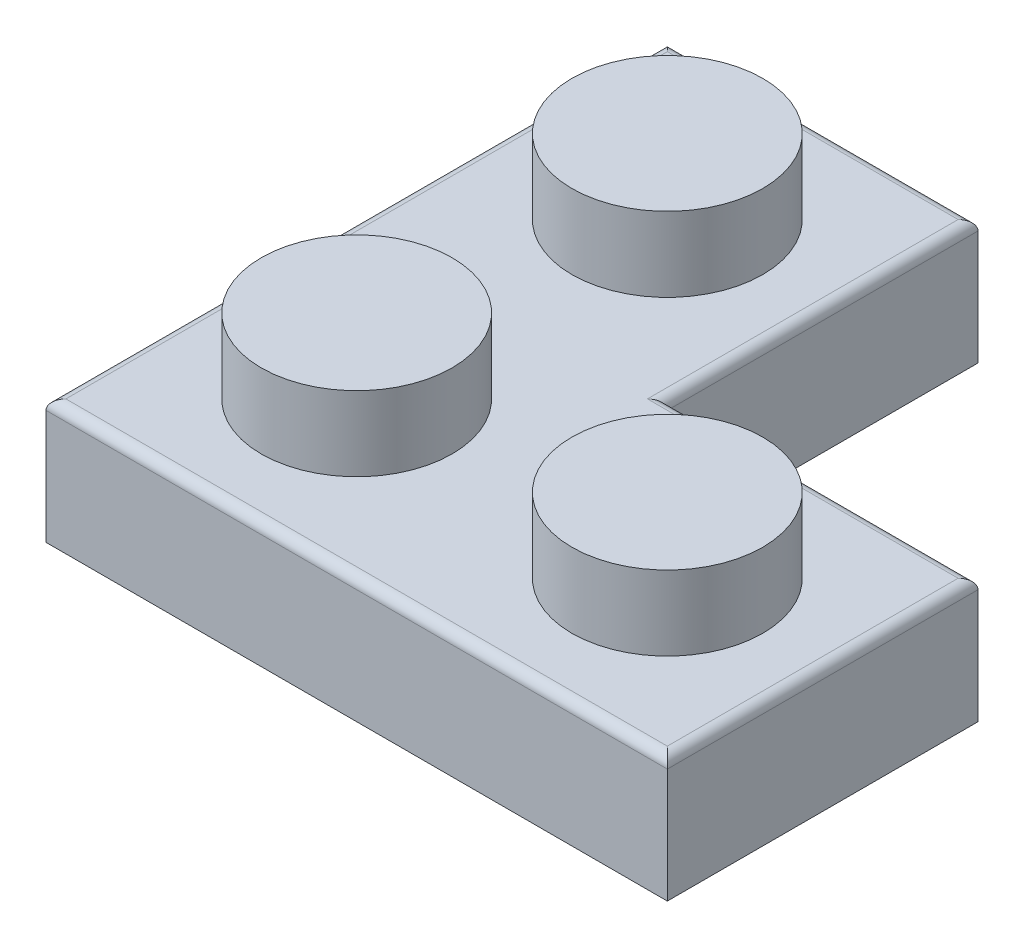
ISO-10303-21;
HEADER;
FILE_DESCRIPTION(('STEP AP214'),'2;1');
FILE_NAME('part.step','',(''),(''),'','','');
FILE_SCHEMA(('AUTOMOTIVE_DESIGN { 1 0 10303 214 1 1 1 1 }'));
ENDSEC;
DATA;
#1=APPLICATION_CONTEXT('core data for automotive mechanical design processes');
#2=APPLICATION_PROTOCOL_DEFINITION('international standard','automotive_design',2000,#1);
#3=PRODUCT_CONTEXT('',#1,'mechanical');
#4=PRODUCT('Part','Part','',(#3));
#5=PRODUCT_RELATED_PRODUCT_CATEGORY('part','',(#4));
#6=PRODUCT_DEFINITION_FORMATION('','',#4);
#7=PRODUCT_DEFINITION_CONTEXT('part definition',#1,'design');
#8=PRODUCT_DEFINITION('design','',#6,#7);
#9=PRODUCT_DEFINITION_SHAPE('','',#8);
#10=(LENGTH_UNIT() NAMED_UNIT(*) SI_UNIT(.MILLI.,.METRE.));
#11=(NAMED_UNIT(*) PLANE_ANGLE_UNIT() SI_UNIT($,.RADIAN.));
#12=(NAMED_UNIT(*) SI_UNIT($,.STERADIAN.) SOLID_ANGLE_UNIT());
#13=UNCERTAINTY_MEASURE_WITH_UNIT(LENGTH_MEASURE(1.E-05),#10,'distance_accuracy_value','');
#14=(GEOMETRIC_REPRESENTATION_CONTEXT(3) GLOBAL_UNCERTAINTY_ASSIGNED_CONTEXT((#13)) GLOBAL_UNIT_ASSIGNED_CONTEXT((#10,
#11,#12)) REPRESENTATION_CONTEXT('',''));
#15=CARTESIAN_POINT('',(0.,0.,0.));
#16=DIRECTION('',(0.,0.,1.));
#17=DIRECTION('',(1.,0.,0.));
#18=AXIS2_PLACEMENT_3D('',#15,#16,#17);
#19=CARTESIAN_POINT('',(-7.9375,1.5875,7.9375));
#20=DIRECTION('',(0.,-1.,0.));
#21=DIRECTION('',(0.,0.,-1.));
#22=AXIS2_PLACEMENT_3D('',#19,#20,#21);
#23=PLANE('',#22);
#24=CARTESIAN_POINT('',(-3.81000000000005,1.5875,0.));
#25=DIRECTION('',(0.,-1.,0.));
#26=DIRECTION('',(0.,0.,-1.));
#27=AXIS2_PLACEMENT_3D('',#24,#25,#26);
#28=CIRCLE('',#27,1.27);
#29=CARTESIAN_POINT('',(-3.81000000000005,1.5875,1.27));
#30=VERTEX_POINT('',#29);
#31=EDGE_CURVE('E323',#30,#30,#28,.T.);
#32=ORIENTED_EDGE('',*,*,#31,.F.);
#33=EDGE_LOOP('',(#32));
#34=FACE_BOUND('',#33,.T.);
#35=CARTESIAN_POINT('',(-3.96875,1.5875,-3.96875));
#36=DIRECTION('',(0.,-1.,0.));
#37=DIRECTION('',(0.,0.,-1.));
#38=AXIS2_PLACEMENT_3D('',#35,#36,#37);
#39=CIRCLE('',#38,0.8509);
#40=CARTESIAN_POINT('',(-3.96875,1.5875,-4.81965));
#41=VERTEX_POINT('',#40);
#42=EDGE_CURVE('E194',#41,#41,#39,.F.);
#43=ORIENTED_EDGE('',*,*,#42,.T.);
#44=EDGE_LOOP('',(#43));
#45=FACE_BOUND('',#44,.T.);
#46=CARTESIAN_POINT('',(3.96875,1.5875,3.96875));
#47=DIRECTION('',(0.,-1.,0.));
#48=DIRECTION('',(0.,0.,-1.));
#49=AXIS2_PLACEMENT_3D('',#46,#47,#48);
#50=CIRCLE('',#49,0.8509);
#51=CARTESIAN_POINT('',(3.96875,1.5875,3.11785));
#52=VERTEX_POINT('',#51);
#53=EDGE_CURVE('E330',#52,#52,#50,.F.);
#54=ORIENTED_EDGE('',*,*,#53,.T.);
#55=EDGE_LOOP('',(#54));
#56=FACE_BOUND('',#55,.T.);
#57=CARTESIAN_POINT('',(-3.96875,1.5875,3.96875));
#58=DIRECTION('',(0.,-1.,0.));
#59=DIRECTION('',(0.,0.,-1.));
#60=AXIS2_PLACEMENT_3D('',#57,#58,#59);
#61=CIRCLE('',#60,0.8509);
#62=CARTESIAN_POINT('',(-3.96875,1.5875,3.11785));
#63=VERTEX_POINT('',#62);
#64=EDGE_CURVE('E182',#63,#63,#61,.F.);
#65=ORIENTED_EDGE('',*,*,#64,.T.);
#66=EDGE_LOOP('',(#65));
#67=FACE_BOUND('',#66,.T.);
#68=DIRECTION('',(0.,0.,1.));
#69=VECTOR('',#68,1.);
#70=CARTESIAN_POINT('',(-1.5875,1.5875,7.9375));
#71=LINE('',#70,#69);
#72=CARTESIAN_POINT('',(-1.5875,1.5875,-6.35));
#73=VERTEX_POINT('',#72);
#74=CARTESIAN_POINT('',(-1.5875,1.5875,1.5875));
#75=VERTEX_POINT('',#74);
#76=EDGE_CURVE('E142',#73,#75,#71,.T.);
#77=ORIENTED_EDGE('',*,*,#76,.T.);
#78=DIRECTION('',(1.,0.,0.));
#79=VECTOR('',#78,1.);
#80=CARTESIAN_POINT('',(-7.9375,1.5875,1.5875));
#81=LINE('',#80,#79);
#82=CARTESIAN_POINT('',(6.35,1.5875,1.5875));
#83=VERTEX_POINT('',#82);
#84=EDGE_CURVE('E147',#75,#83,#81,.T.);
#85=ORIENTED_EDGE('',*,*,#84,.T.);
#86=DIRECTION('',(0.,0.,-1.));
#87=VECTOR('',#86,1.);
#88=CARTESIAN_POINT('',(6.35,1.5875,7.9375));
#89=LINE('',#88,#87);
#90=CARTESIAN_POINT('',(6.35,1.5875,6.35));
#91=VERTEX_POINT('',#90);
#92=EDGE_CURVE('E173',#91,#83,#89,.T.);
#93=ORIENTED_EDGE('',*,*,#92,.F.);
#94=DIRECTION('',(-1.,0.,0.));
#95=VECTOR('',#94,1.);
#96=CARTESIAN_POINT('',(-7.9375,1.5875,6.35));
#97=LINE('',#96,#95);
#98=CARTESIAN_POINT('',(-6.35,1.5875,6.35));
#99=VERTEX_POINT('',#98);
#100=EDGE_CURVE('E336',#91,#99,#97,.T.);
#101=ORIENTED_EDGE('',*,*,#100,.T.);
#102=DIRECTION('',(0.,0.,1.));
#103=VECTOR('',#102,1.);
#104=CARTESIAN_POINT('',(-6.35,1.5875,7.9375));
#105=LINE('',#104,#103);
#106=CARTESIAN_POINT('',(-6.35,1.5875,-6.35));
#107=VERTEX_POINT('',#106);
#108=EDGE_CURVE('E205',#107,#99,#105,.T.);
#109=ORIENTED_EDGE('',*,*,#108,.F.);
#110=DIRECTION('',(1.,0.,0.));
#111=VECTOR('',#110,1.);
#112=CARTESIAN_POINT('',(-7.9375,1.5875,-6.35));
#113=LINE('',#112,#111);
#114=EDGE_CURVE('E151',#107,#73,#113,.T.);
#115=ORIENTED_EDGE('',*,*,#114,.T.);
#116=EDGE_LOOP('',(#77,#85,#93,#101,#109,#115));
#117=FACE_BOUND('',#116,.T.);
#118=CARTESIAN_POINT('',(0.,1.5875,3.80999999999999));
#119=DIRECTION('',(0.,-1.,0.));
#120=DIRECTION('',(0.,0.,-1.));
#121=AXIS2_PLACEMENT_3D('',#118,#119,#120);
#122=CIRCLE('',#121,1.27);
#123=CARTESIAN_POINT('',(0.,1.5875,5.07999999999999));
#124=VERTEX_POINT('',#123);
#125=EDGE_CURVE('E317',#124,#124,#122,.T.);
#126=ORIENTED_EDGE('',*,*,#125,.F.);
#127=EDGE_LOOP('',(#126));
#128=FACE_BOUND('',#127,.T.);
#129=ADVANCED_FACE('F36',(#34,#45,#56,#67,#117,#128),#23,.T.);
#130=CARTESIAN_POINT('',(-7.9375,3.175,7.9375));
#131=DIRECTION('',(0.,-1.,0.));
#132=DIRECTION('',(0.,0.,-1.));
#133=AXIS2_PLACEMENT_3D('',#130,#131,#132);
#134=PLANE('',#133);
#135=DIRECTION('',(0.,0.,-1.));
#136=VECTOR('',#135,1.);
#137=CARTESIAN_POINT('',(7.6835,3.175,7.9375));
#138=LINE('',#137,#136);
#139=CARTESIAN_POINT('',(7.6835,3.175,7.6835));
#140=VERTEX_POINT('',#139);
#141=CARTESIAN_POINT('',(7.6835,3.175,0.254));
#142=VERTEX_POINT('',#141);
#143=EDGE_CURVE('E267',#140,#142,#138,.T.);
#144=ORIENTED_EDGE('',*,*,#143,.T.);
#145=DIRECTION('',(1.,0.,0.));
#146=VECTOR('',#145,1.);
#147=CARTESIAN_POINT('',(0.,3.175,0.254));
#148=LINE('',#147,#146);
#149=CARTESIAN_POINT('',(-0.254,3.175,0.254));
#150=VERTEX_POINT('',#149);
#151=EDGE_CURVE('E269',#142,#150,#148,.F.);
#152=ORIENTED_EDGE('',*,*,#151,.T.);
#153=DIRECTION('',(0.,0.,1.));
#154=VECTOR('',#153,1.);
#155=CARTESIAN_POINT('',(-0.254,3.175,-7.9375));
#156=LINE('',#155,#154);
#157=CARTESIAN_POINT('',(-0.254,3.175,-7.6835));
#158=VERTEX_POINT('',#157);
#159=EDGE_CURVE('E259',#150,#158,#156,.F.);
#160=ORIENTED_EDGE('',*,*,#159,.T.);
#161=DIRECTION('',(1.,0.,0.));
#162=VECTOR('',#161,1.);
#163=CARTESIAN_POINT('',(-7.9375,3.175,-7.6835));
#164=LINE('',#163,#162);
#165=CARTESIAN_POINT('',(-7.6835,3.175,-7.6835));
#166=VERTEX_POINT('',#165);
#167=EDGE_CURVE('E261',#158,#166,#164,.F.);
#168=ORIENTED_EDGE('',*,*,#167,.T.);
#169=DIRECTION('',(0.,0.,1.));
#170=VECTOR('',#169,1.);
#171=CARTESIAN_POINT('',(-7.6835,3.175,7.9375));
#172=LINE('',#171,#170);
#173=CARTESIAN_POINT('',(-7.6835,3.175,7.6835));
#174=VERTEX_POINT('',#173);
#175=EDGE_CURVE('E263',#166,#174,#172,.T.);
#176=ORIENTED_EDGE('',*,*,#175,.T.);
#177=DIRECTION('',(-1.,0.,0.));
#178=VECTOR('',#177,1.);
#179=CARTESIAN_POINT('',(7.9375,3.175,7.6835));
#180=LINE('',#179,#178);
#181=EDGE_CURVE('E265',#174,#140,#180,.F.);
#182=ORIENTED_EDGE('',*,*,#181,.T.);
#183=EDGE_LOOP('',(#144,#152,#160,#168,#176,#182));
#184=FACE_BOUND('',#183,.T.);
#185=CARTESIAN_POINT('',(-3.96875,3.175,-3.96875));
#186=DIRECTION('',(0.,-1.,0.));
#187=DIRECTION('',(0.,0.,-1.));
#188=AXIS2_PLACEMENT_3D('',#185,#186,#187);
#189=CIRCLE('',#188,2.4384);
#190=CARTESIAN_POINT('',(-3.96875,3.175,-6.40715));
#191=VERTEX_POINT('',#190);
#192=EDGE_CURVE('E244',#191,#191,#189,.F.);
#193=ORIENTED_EDGE('',*,*,#192,.F.);
#194=EDGE_LOOP('',(#193));
#195=FACE_BOUND('',#194,.T.);
#196=CARTESIAN_POINT('',(3.96875,3.175,3.96875));
#197=DIRECTION('',(0.,-1.,0.));
#198=DIRECTION('',(0.,0.,-1.));
#199=AXIS2_PLACEMENT_3D('',#196,#197,#198);
#200=CIRCLE('',#199,2.4384);
#201=CARTESIAN_POINT('',(3.96875,3.175,1.53035));
#202=VERTEX_POINT('',#201);
#203=EDGE_CURVE('E241',#202,#202,#200,.F.);
#204=ORIENTED_EDGE('',*,*,#203,.F.);
#205=EDGE_LOOP('',(#204));
#206=FACE_BOUND('',#205,.T.);
#207=CARTESIAN_POINT('',(-3.96875,3.175,3.96875));
#208=DIRECTION('',(0.,-1.,0.));
#209=DIRECTION('',(0.,0.,-1.));
#210=AXIS2_PLACEMENT_3D('',#207,#208,#209);
#211=CIRCLE('',#210,2.4384);
#212=CARTESIAN_POINT('',(-3.96875,3.175,1.53035));
#213=VERTEX_POINT('',#212);
#214=EDGE_CURVE('E238',#213,#213,#211,.F.);
#215=ORIENTED_EDGE('',*,*,#214,.F.);
#216=EDGE_LOOP('',(#215));
#217=FACE_BOUND('',#216,.T.);
#218=ADVANCED_FACE('F365',(#184,#195,#206,#217),#134,.F.);
#219=CARTESIAN_POINT('',(7.9375,3.175,7.9375));
#220=DIRECTION('',(-1.,0.,0.));
#221=DIRECTION('',(0.,0.,1.));
#222=AXIS2_PLACEMENT_3D('',#219,#220,#221);
#223=PLANE('',#222);
#224=DIRECTION('',(0.,-1.,0.));
#225=VECTOR('',#224,1.);
#226=CARTESIAN_POINT('',(7.9375,31.9477532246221,0.));
#227=LINE('',#226,#225);
#228=CARTESIAN_POINT('',(7.9375,2.921,0.));
#229=VERTEX_POINT('',#228);
#230=CARTESIAN_POINT('',(7.9375,0.,0.));
#231=VERTEX_POINT('',#230);
#232=EDGE_CURVE('E209',#229,#231,#227,.T.);
#233=ORIENTED_EDGE('',*,*,#232,.F.);
#234=DIRECTION('',(0.,0.,-1.));
#235=VECTOR('',#234,1.);
#236=CARTESIAN_POINT('',(7.9375,2.921,7.9375));
#237=LINE('',#236,#235);
#238=CARTESIAN_POINT('',(7.9375,2.921,7.9375));
#239=VERTEX_POINT('',#238);
#240=EDGE_CURVE('E272',#229,#239,#237,.F.);
#241=ORIENTED_EDGE('',*,*,#240,.T.);
#242=DIRECTION('',(0.,-1.,0.));
#243=VECTOR('',#242,1.);
#244=CARTESIAN_POINT('',(7.9375,3.175,7.9375));
#245=LINE('',#244,#243);
#246=CARTESIAN_POINT('',(7.9375,0.,7.9375));
#247=VERTEX_POINT('',#246);
#248=EDGE_CURVE('E234',#239,#247,#245,.T.);
#249=ORIENTED_EDGE('',*,*,#248,.T.);
#250=DIRECTION('',(0.,0.,-1.));
#251=VECTOR('',#250,1.);
#252=CARTESIAN_POINT('',(7.9375,0.,7.9375));
#253=LINE('',#252,#251);
#254=EDGE_CURVE('E226',#247,#231,#253,.T.);
#255=ORIENTED_EDGE('',*,*,#254,.T.);
#256=EDGE_LOOP('',(#233,#241,#249,#255));
#257=FACE_BOUND('',#256,.T.);
#258=ADVANCED_FACE('F371',(#257),#223,.F.);
#259=CARTESIAN_POINT('',(-7.9375,3.175,-7.9375));
#260=DIRECTION('',(0.,0.,-1.));
#261=DIRECTION('',(-1.,0.,0.));
#262=AXIS2_PLACEMENT_3D('',#259,#260,#261);
#263=PLANE('',#262);
#264=DIRECTION('',(0.,-1.,0.));
#265=VECTOR('',#264,1.);
#266=CARTESIAN_POINT('',(-7.9375,3.175,-7.9375));
#267=LINE('',#266,#265);
#268=CARTESIAN_POINT('',(-7.9375,2.921,-7.9375));
#269=VERTEX_POINT('',#268);
#270=CARTESIAN_POINT('',(-7.9375,0.,-7.9375));
#271=VERTEX_POINT('',#270);
#272=EDGE_CURVE('E232',#269,#271,#267,.T.);
#273=ORIENTED_EDGE('',*,*,#272,.F.);
#274=DIRECTION('',(1.,0.,0.));
#275=VECTOR('',#274,1.);
#276=CARTESIAN_POINT('',(0.,2.921,-7.9375));
#277=LINE('',#276,#275);
#278=CARTESIAN_POINT('',(0.,2.921,-7.9375));
#279=VERTEX_POINT('',#278);
#280=EDGE_CURVE('E44',#269,#279,#277,.T.);
#281=ORIENTED_EDGE('',*,*,#280,.T.);
#282=DIRECTION('',(0.,-1.,0.));
#283=VECTOR('',#282,1.);
#284=CARTESIAN_POINT('',(0.,31.9477532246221,-7.9375));
#285=LINE('',#284,#283);
#286=CARTESIAN_POINT('',(0.,0.,-7.9375));
#287=VERTEX_POINT('',#286);
#288=EDGE_CURVE('E211',#279,#287,#285,.T.);
#289=ORIENTED_EDGE('',*,*,#288,.T.);
#290=DIRECTION('',(1.,0.,0.));
#291=VECTOR('',#290,1.);
#292=CARTESIAN_POINT('',(-7.9375,0.,-7.9375));
#293=LINE('',#292,#291);
#294=EDGE_CURVE('E229',#271,#287,#293,.T.);
#295=ORIENTED_EDGE('',*,*,#294,.F.);
#296=EDGE_LOOP('',(#273,#281,#289,#295));
#297=FACE_BOUND('',#296,.T.);
#298=ADVANCED_FACE('F455',(#297),#263,.T.);
#299=CARTESIAN_POINT('',(-7.9375,0.,7.9375));
#300=DIRECTION('',(0.,-1.,0.));
#301=DIRECTION('',(0.,0.,-1.));
#302=AXIS2_PLACEMENT_3D('',#299,#300,#301);
#303=PLANE('',#302);
#304=DIRECTION('',(1.,0.,0.));
#305=VECTOR('',#304,1.);
#306=CARTESIAN_POINT('',(-7.9375,0.,-6.35));
#307=LINE('',#306,#305);
#308=CARTESIAN_POINT('',(-6.35,0.,-6.35));
#309=VERTEX_POINT('',#308);
#310=CARTESIAN_POINT('',(-1.5875,0.,-6.35));
#311=VERTEX_POINT('',#310);
#312=EDGE_CURVE('E198',#309,#311,#307,.T.);
#313=ORIENTED_EDGE('',*,*,#312,.F.);
#314=DIRECTION('',(0.,0.,1.));
#315=VECTOR('',#314,1.);
#316=CARTESIAN_POINT('',(-6.35,0.,7.9375));
#317=LINE('',#316,#315);
#318=CARTESIAN_POINT('',(-6.35,0.,6.35));
#319=VERTEX_POINT('',#318);
#320=EDGE_CURVE('E187',#309,#319,#317,.T.);
#321=ORIENTED_EDGE('',*,*,#320,.T.);
#322=DIRECTION('',(-1.,0.,0.));
#323=VECTOR('',#322,1.);
#324=CARTESIAN_POINT('',(-7.9375,0.,6.35));
#325=LINE('',#324,#323);
#326=CARTESIAN_POINT('',(6.35,0.,6.35));
#327=VERTEX_POINT('',#326);
#328=EDGE_CURVE('E199',#327,#319,#325,.T.);
#329=ORIENTED_EDGE('',*,*,#328,.F.);
#330=DIRECTION('',(0.,0.,-1.));
#331=VECTOR('',#330,1.);
#332=CARTESIAN_POINT('',(6.35,0.,7.9375));
#333=LINE('',#332,#331);
#334=CARTESIAN_POINT('',(6.35,0.,1.5875));
#335=VERTEX_POINT('',#334);
#336=EDGE_CURVE('E195',#327,#335,#333,.T.);
#337=ORIENTED_EDGE('',*,*,#336,.T.);
#338=DIRECTION('',(1.,0.,0.));
#339=VECTOR('',#338,1.);
#340=CARTESIAN_POINT('',(-7.9375,0.,1.5875));
#341=LINE('',#340,#339);
#342=CARTESIAN_POINT('',(-1.5875,0.,1.5875));
#343=VERTEX_POINT('',#342);
#344=EDGE_CURVE('E193',#343,#335,#341,.T.);
#345=ORIENTED_EDGE('',*,*,#344,.F.);
#346=DIRECTION('',(0.,0.,1.));
#347=VECTOR('',#346,1.);
#348=CARTESIAN_POINT('',(-1.5875,0.,7.9375));
#349=LINE('',#348,#347);
#350=EDGE_CURVE('E159',#311,#343,#349,.T.);
#351=ORIENTED_EDGE('',*,*,#350,.F.);
#352=EDGE_LOOP('',(#313,#321,#329,#337,#345,#351));
#353=FACE_BOUND('',#352,.T.);
#354=ORIENTED_EDGE('',*,*,#294,.T.);
#355=DIRECTION('',(0.,0.,1.));
#356=VECTOR('',#355,1.);
#357=CARTESIAN_POINT('',(0.,0.,7.9375));
#358=LINE('',#357,#356);
#359=CARTESIAN_POINT('',(0.,0.,0.));
#360=VERTEX_POINT('',#359);
#361=EDGE_CURVE('E253',#287,#360,#358,.T.);
#362=ORIENTED_EDGE('',*,*,#361,.T.);
#363=DIRECTION('',(1.,0.,0.));
#364=VECTOR('',#363,1.);
#365=CARTESIAN_POINT('',(-7.9375,0.,0.));
#366=LINE('',#365,#364);
#367=EDGE_CURVE('E250',#360,#231,#366,.T.);
#368=ORIENTED_EDGE('',*,*,#367,.T.);
#369=ORIENTED_EDGE('',*,*,#254,.F.);
#370=DIRECTION('',(-1.,0.,0.));
#371=VECTOR('',#370,1.);
#372=CARTESIAN_POINT('',(7.9375,0.,7.9375));
#373=LINE('',#372,#371);
#374=CARTESIAN_POINT('',(-7.9375,0.,7.9375));
#375=VERTEX_POINT('',#374);
#376=EDGE_CURVE('E223',#247,#375,#373,.T.);
#377=ORIENTED_EDGE('',*,*,#376,.T.);
#378=DIRECTION('',(0.,0.,1.));
#379=VECTOR('',#378,1.);
#380=CARTESIAN_POINT('',(-7.9375,0.,-7.9375));
#381=LINE('',#380,#379);
#382=EDGE_CURVE('E220',#271,#375,#381,.T.);
#383=ORIENTED_EDGE('',*,*,#382,.F.);
#384=EDGE_LOOP('',(#354,#362,#368,#369,#377,#383));
#385=FACE_BOUND('',#384,.T.);
#386=ADVANCED_FACE('F351',(#353,#385),#303,.T.);
#387=CARTESIAN_POINT('',(-7.9375,3.175,-7.9375));
#388=DIRECTION('',(1.,0.,0.));
#389=DIRECTION('',(0.,0.,-1.));
#390=AXIS2_PLACEMENT_3D('',#387,#388,#389);
#391=PLANE('',#390);
#392=DIRECTION('',(0.,-1.,0.));
#393=VECTOR('',#392,1.);
#394=CARTESIAN_POINT('',(-7.9375,3.175,7.9375));
#395=LINE('',#394,#393);
#396=CARTESIAN_POINT('',(-7.9375,2.921,7.9375));
#397=VERTEX_POINT('',#396);
#398=EDGE_CURVE('E236',#397,#375,#395,.T.);
#399=ORIENTED_EDGE('',*,*,#398,.F.);
#400=DIRECTION('',(0.,0.,1.));
#401=VECTOR('',#400,1.);
#402=CARTESIAN_POINT('',(-7.9375,2.921,-7.9375));
#403=LINE('',#402,#401);
#404=EDGE_CURVE('E58',#397,#269,#403,.F.);
#405=ORIENTED_EDGE('',*,*,#404,.T.);
#406=ORIENTED_EDGE('',*,*,#272,.T.);
#407=ORIENTED_EDGE('',*,*,#382,.T.);
#408=EDGE_LOOP('',(#399,#405,#406,#407));
#409=FACE_BOUND('',#408,.T.);
#410=ADVANCED_FACE('F285',(#409),#391,.F.);
#411=CARTESIAN_POINT('',(7.9375,3.175,7.9375));
#412=DIRECTION('',(0.,0.,1.));
#413=DIRECTION('',(1.,0.,0.));
#414=AXIS2_PLACEMENT_3D('',#411,#412,#413);
#415=PLANE('',#414);
#416=ORIENTED_EDGE('',*,*,#248,.F.);
#417=DIRECTION('',(-1.,0.,0.));
#418=VECTOR('',#417,1.);
#419=CARTESIAN_POINT('',(-7.9375,2.921,7.9375));
#420=LINE('',#419,#418);
#421=EDGE_CURVE('E274',#239,#397,#420,.T.);
#422=ORIENTED_EDGE('',*,*,#421,.T.);
#423=ORIENTED_EDGE('',*,*,#398,.T.);
#424=ORIENTED_EDGE('',*,*,#376,.F.);
#425=EDGE_LOOP('',(#416,#422,#423,#424));
#426=FACE_BOUND('',#425,.T.);
#427=ADVANCED_FACE('F279',(#426),#415,.T.);
#428=CARTESIAN_POINT('',(-3.96875,5.08,3.96875));
#429=DIRECTION('',(0.,-1.,0.));
#430=DIRECTION('',(0.,0.,-1.));
#431=AXIS2_PLACEMENT_3D('',#428,#429,#430);
#432=CYLINDRICAL_SURFACE('',#431,2.4384);
#433=CARTESIAN_POINT('',(-3.96875,5.08,3.96875));
#434=DIRECTION('',(0.,1.,0.));
#435=DIRECTION('',(0.,0.,1.));
#436=AXIS2_PLACEMENT_3D('',#433,#434,#435);
#437=CIRCLE('',#436,2.4384);
#438=CARTESIAN_POINT('',(-3.96875,5.08,1.53035));
#439=VERTEX_POINT('',#438);
#440=EDGE_CURVE('E217',#439,#439,#437,.T.);
#441=CARTESIAN_POINT('',(-3.96875,5.08,1.53035));
#442=CARTESIAN_POINT('',(-3.96875,5.06015625,1.53035));
#443=CARTESIAN_POINT('',(-3.96875,5.0403125,1.53035));
#444=CARTESIAN_POINT('',(-3.96875,5.000625,1.53035));
#445=CARTESIAN_POINT('',(-3.96875,4.98078125,1.53035));
#446=CARTESIAN_POINT('',(-3.96875,4.94109375,1.53035));
#447=CARTESIAN_POINT('',(-3.96875,4.92125,1.53035));
#448=CARTESIAN_POINT('',(-3.96875,4.8815625,1.53035));
#449=CARTESIAN_POINT('',(-3.96875,4.86171875,1.53035));
#450=CARTESIAN_POINT('',(-3.96875,4.82203125,1.53035));
#451=CARTESIAN_POINT('',(-3.96875,4.8021875,1.53035));
#452=CARTESIAN_POINT('',(-3.96875,4.7625,1.53035));
#453=CARTESIAN_POINT('',(-3.96875,4.74265625,1.53035));
#454=CARTESIAN_POINT('',(-3.96875,4.70296875,1.53035));
#455=CARTESIAN_POINT('',(-3.96875,4.683125,1.53035));
#456=CARTESIAN_POINT('',(-3.96875,4.6434375,1.53035));
#457=CARTESIAN_POINT('',(-3.96875,4.62359375,1.53035));
#458=CARTESIAN_POINT('',(-3.96875,4.58390625,1.53035));
#459=CARTESIAN_POINT('',(-3.96875,4.5640625,1.53035));
#460=CARTESIAN_POINT('',(-3.96875,4.524375,1.53035));
#461=CARTESIAN_POINT('',(-3.96875,4.50453125,1.53035));
#462=CARTESIAN_POINT('',(-3.96875,4.46484375,1.53035));
#463=CARTESIAN_POINT('',(-3.96875,4.445,1.53035));
#464=CARTESIAN_POINT('',(-3.96875,4.4053125,1.53035));
#465=CARTESIAN_POINT('',(-3.96875,4.38546875,1.53035));
#466=CARTESIAN_POINT('',(-3.96875,4.34578125,1.53035));
#467=CARTESIAN_POINT('',(-3.96875,4.3259375,1.53035));
#468=CARTESIAN_POINT('',(-3.96875,4.28625,1.53035));
#469=CARTESIAN_POINT('',(-3.96875,4.26640625,1.53035));
#470=CARTESIAN_POINT('',(-3.96875,4.22671875,1.53035));
#471=CARTESIAN_POINT('',(-3.96875,4.206875,1.53035));
#472=CARTESIAN_POINT('',(-3.96875,4.1671875,1.53035));
#473=CARTESIAN_POINT('',(-3.96875,4.14734375,1.53035));
#474=CARTESIAN_POINT('',(-3.96875,4.10765625,1.53035));
#475=CARTESIAN_POINT('',(-3.96875,4.0878125,1.53035));
#476=CARTESIAN_POINT('',(-3.96875,4.048125,1.53035));
#477=CARTESIAN_POINT('',(-3.96875,4.02828125,1.53035));
#478=CARTESIAN_POINT('',(-3.96875,3.98859375,1.53035));
#479=CARTESIAN_POINT('',(-3.96875,3.96875,1.53035));
#480=CARTESIAN_POINT('',(-3.96875,3.9290625,1.53035));
#481=CARTESIAN_POINT('',(-3.96875,3.90921875,1.53035));
#482=CARTESIAN_POINT('',(-3.96875,3.86953125,1.53035));
#483=CARTESIAN_POINT('',(-3.96875,3.8496875,1.53035));
#484=CARTESIAN_POINT('',(-3.96875,3.81,1.53035));
#485=CARTESIAN_POINT('',(-3.96875,3.79015625,1.53035));
#486=CARTESIAN_POINT('',(-3.96875,3.75046875,1.53035));
#487=CARTESIAN_POINT('',(-3.96875,3.730625,1.53035));
#488=CARTESIAN_POINT('',(-3.96875,3.6909375,1.53035));
#489=CARTESIAN_POINT('',(-3.96875,3.67109375,1.53035));
#490=CARTESIAN_POINT('',(-3.96875,3.63140625,1.53035));
#491=CARTESIAN_POINT('',(-3.96875,3.6115625,1.53035));
#492=CARTESIAN_POINT('',(-3.96875,3.571875,1.53035));
#493=CARTESIAN_POINT('',(-3.96875,3.55203125,1.53035));
#494=CARTESIAN_POINT('',(-3.96875,3.51234375,1.53035));
#495=CARTESIAN_POINT('',(-3.96875,3.4925,1.53035));
#496=CARTESIAN_POINT('',(-3.96875,3.4528125,1.53035));
#497=CARTESIAN_POINT('',(-3.96875,3.43296875,1.53035));
#498=CARTESIAN_POINT('',(-3.96875,3.39328125,1.53035));
#499=CARTESIAN_POINT('',(-3.96875,3.3734375,1.53035));
#500=CARTESIAN_POINT('',(-3.96875,3.33375,1.53035));
#501=CARTESIAN_POINT('',(-3.96875,3.31390625,1.53035));
#502=CARTESIAN_POINT('',(-3.96875,3.27421875,1.53035));
#503=CARTESIAN_POINT('',(-3.96875,3.254375,1.53035));
#504=CARTESIAN_POINT('',(-3.96875,3.2146875,1.53035));
#505=CARTESIAN_POINT('',(-3.96875,3.19484375,1.53035));
#506=CARTESIAN_POINT('',(-3.96875,3.175,1.53035));
#507=B_SPLINE_CURVE_WITH_KNOTS('',3,(#441,#442,#443,#444,#445,#446,#447,#448,#449,#450,#451,
#452,#453,#454,#455,#456,#457,#458,#459,#460,#461,#462,#463,#464,#465,#466,#467,#468,#469,#470,
#471,#472,#473,#474,#475,#476,#477,#478,#479,#480,#481,#482,#483,#484,#485,#486,#487,#488,#489,
#490,#491,#492,#493,#494,#495,#496,#497,#498,#499,#500,#501,#502,#503,#504,#505,#506),
.UNSPECIFIED.,.F.,.F.,(4,2,2,2,2,2,2,2,2,2,2,2,2,2,2,2,2,2,2,2,2,2,2,2,2,2,2,2,2,2,2,2,4),(0.,
0.0595312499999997,0.119062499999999,0.178593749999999,0.238125,0.297656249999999,
0.357187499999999,0.41671875,0.476249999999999,0.535781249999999,0.595312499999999,
0.654843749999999,0.714374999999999,0.773906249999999,0.833437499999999,0.892968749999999,
0.952499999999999,1.01203125,1.0715625,1.13109375,1.190625,1.25015625,1.3096875,1.36921875,
1.42875,1.48828125,1.5478125,1.60734375,1.666875,1.72640625,1.7859375,1.84546875,1.905),.UNSPECIFIED.);
#508=EDGE_CURVE('BSEAM467',#439,#213,#507,.T.);
#509=ORIENTED_EDGE('',*,*,#440,.F.);
#510=ORIENTED_EDGE('',*,*,#214,.T.);
#511=ORIENTED_EDGE('',*,*,#508,.T.);
#512=ORIENTED_EDGE('',*,*,#508,.F.);
#513=EDGE_LOOP('',(#509,#511,#510,#512));
#514=FACE_BOUND('',#513,.T.);
#515=ADVANCED_FACE('F467',(#514),#432,.T.);
#516=CARTESIAN_POINT('',(-3.96875,5.08,3.96875));
#517=DIRECTION('',(0.,1.,0.));
#518=DIRECTION('',(0.,0.,1.));
#519=AXIS2_PLACEMENT_3D('',#516,#517,#518);
#520=PLANE('',#519);
#521=ORIENTED_EDGE('',*,*,#440,.T.);
#522=EDGE_LOOP('',(#521));
#523=FACE_BOUND('',#522,.T.);
#524=ADVANCED_FACE('F489',(#523),#520,.T.);
#525=CARTESIAN_POINT('',(3.96875,5.08,3.96875));
#526=DIRECTION('',(0.,-1.,0.));
#527=DIRECTION('',(0.,0.,-1.));
#528=AXIS2_PLACEMENT_3D('',#525,#526,#527);
#529=CYLINDRICAL_SURFACE('',#528,2.4384);
#530=CARTESIAN_POINT('',(3.96875,5.08,3.96875));
#531=DIRECTION('',(0.,1.,0.));
#532=DIRECTION('',(0.,0.,1.));
#533=AXIS2_PLACEMENT_3D('',#530,#531,#532);
#534=CIRCLE('',#533,2.4384);
#535=CARTESIAN_POINT('',(3.96875,5.08,1.53035));
#536=VERTEX_POINT('',#535);
#537=EDGE_CURVE('E214',#536,#536,#534,.T.);
#538=CARTESIAN_POINT('',(3.96875,5.08,1.53035));
#539=CARTESIAN_POINT('',(3.96875,5.06015625,1.53035));
#540=CARTESIAN_POINT('',(3.96875,5.0403125,1.53035));
#541=CARTESIAN_POINT('',(3.96875,5.000625,1.53035));
#542=CARTESIAN_POINT('',(3.96875,4.98078125,1.53035));
#543=CARTESIAN_POINT('',(3.96875,4.94109375,1.53035));
#544=CARTESIAN_POINT('',(3.96875,4.92125,1.53035));
#545=CARTESIAN_POINT('',(3.96875,4.8815625,1.53035));
#546=CARTESIAN_POINT('',(3.96875,4.86171875,1.53035));
#547=CARTESIAN_POINT('',(3.96875,4.82203125,1.53035));
#548=CARTESIAN_POINT('',(3.96875,4.8021875,1.53035));
#549=CARTESIAN_POINT('',(3.96875,4.7625,1.53035));
#550=CARTESIAN_POINT('',(3.96875,4.74265625,1.53035));
#551=CARTESIAN_POINT('',(3.96875,4.70296875,1.53035));
#552=CARTESIAN_POINT('',(3.96875,4.683125,1.53035));
#553=CARTESIAN_POINT('',(3.96875,4.6434375,1.53035));
#554=CARTESIAN_POINT('',(3.96875,4.62359375,1.53035));
#555=CARTESIAN_POINT('',(3.96875,4.58390625,1.53035));
#556=CARTESIAN_POINT('',(3.96875,4.5640625,1.53035));
#557=CARTESIAN_POINT('',(3.96875,4.524375,1.53035));
#558=CARTESIAN_POINT('',(3.96875,4.50453125,1.53035));
#559=CARTESIAN_POINT('',(3.96875,4.46484375,1.53035));
#560=CARTESIAN_POINT('',(3.96875,4.445,1.53035));
#561=CARTESIAN_POINT('',(3.96875,4.4053125,1.53035));
#562=CARTESIAN_POINT('',(3.96875,4.38546875,1.53035));
#563=CARTESIAN_POINT('',(3.96875,4.34578125,1.53035));
#564=CARTESIAN_POINT('',(3.96875,4.3259375,1.53035));
#565=CARTESIAN_POINT('',(3.96875,4.28625,1.53035));
#566=CARTESIAN_POINT('',(3.96875,4.26640625,1.53035));
#567=CARTESIAN_POINT('',(3.96875,4.22671875,1.53035));
#568=CARTESIAN_POINT('',(3.96875,4.206875,1.53035));
#569=CARTESIAN_POINT('',(3.96875,4.1671875,1.53035));
#570=CARTESIAN_POINT('',(3.96875,4.14734375,1.53035));
#571=CARTESIAN_POINT('',(3.96875,4.10765625,1.53035));
#572=CARTESIAN_POINT('',(3.96875,4.0878125,1.53035));
#573=CARTESIAN_POINT('',(3.96875,4.048125,1.53035));
#574=CARTESIAN_POINT('',(3.96875,4.02828125,1.53035));
#575=CARTESIAN_POINT('',(3.96875,3.98859375,1.53035));
#576=CARTESIAN_POINT('',(3.96875,3.96875,1.53035));
#577=CARTESIAN_POINT('',(3.96875,3.9290625,1.53035));
#578=CARTESIAN_POINT('',(3.96875,3.90921875,1.53035));
#579=CARTESIAN_POINT('',(3.96875,3.86953125,1.53035));
#580=CARTESIAN_POINT('',(3.96875,3.8496875,1.53035));
#581=CARTESIAN_POINT('',(3.96875,3.81,1.53035));
#582=CARTESIAN_POINT('',(3.96875,3.79015625,1.53035));
#583=CARTESIAN_POINT('',(3.96875,3.75046875,1.53035));
#584=CARTESIAN_POINT('',(3.96875,3.730625,1.53035));
#585=CARTESIAN_POINT('',(3.96875,3.6909375,1.53035));
#586=CARTESIAN_POINT('',(3.96875,3.67109375,1.53035));
#587=CARTESIAN_POINT('',(3.96875,3.63140625,1.53035));
#588=CARTESIAN_POINT('',(3.96875,3.6115625,1.53035));
#589=CARTESIAN_POINT('',(3.96875,3.571875,1.53035));
#590=CARTESIAN_POINT('',(3.96875,3.55203125,1.53035));
#591=CARTESIAN_POINT('',(3.96875,3.51234375,1.53035));
#592=CARTESIAN_POINT('',(3.96875,3.4925,1.53035));
#593=CARTESIAN_POINT('',(3.96875,3.4528125,1.53035));
#594=CARTESIAN_POINT('',(3.96875,3.43296875,1.53035));
#595=CARTESIAN_POINT('',(3.96875,3.39328125,1.53035));
#596=CARTESIAN_POINT('',(3.96875,3.3734375,1.53035));
#597=CARTESIAN_POINT('',(3.96875,3.33375,1.53035));
#598=CARTESIAN_POINT('',(3.96875,3.31390625,1.53035));
#599=CARTESIAN_POINT('',(3.96875,3.27421875,1.53035));
#600=CARTESIAN_POINT('',(3.96875,3.254375,1.53035));
#601=CARTESIAN_POINT('',(3.96875,3.2146875,1.53035));
#602=CARTESIAN_POINT('',(3.96875,3.19484375,1.53035));
#603=CARTESIAN_POINT('',(3.96875,3.175,1.53035));
#604=B_SPLINE_CURVE_WITH_KNOTS('',3,(#538,#539,#540,#541,#542,#543,#544,#545,#546,#547,#548,
#549,#550,#551,#552,#553,#554,#555,#556,#557,#558,#559,#560,#561,#562,#563,#564,#565,#566,#567,
#568,#569,#570,#571,#572,#573,#574,#575,#576,#577,#578,#579,#580,#581,#582,#583,#584,#585,#586,
#587,#588,#589,#590,#591,#592,#593,#594,#595,#596,#597,#598,#599,#600,#601,#602,#603),
.UNSPECIFIED.,.F.,.F.,(4,2,2,2,2,2,2,2,2,2,2,2,2,2,2,2,2,2,2,2,2,2,2,2,2,2,2,2,2,2,2,2,4),(0.,
0.0595312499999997,0.119062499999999,0.178593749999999,0.238125,0.297656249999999,
0.357187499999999,0.41671875,0.476249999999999,0.535781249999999,0.595312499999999,
0.654843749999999,0.714374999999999,0.773906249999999,0.833437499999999,0.892968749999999,
0.952499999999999,1.01203125,1.0715625,1.13109375,1.190625,1.25015625,1.3096875,1.36921875,
1.42875,1.48828125,1.5478125,1.60734375,1.666875,1.72640625,1.7859375,1.84546875,1.905),.UNSPECIFIED.);
#605=EDGE_CURVE('BSEAM479',#536,#202,#604,.T.);
#606=ORIENTED_EDGE('',*,*,#537,.F.);
#607=ORIENTED_EDGE('',*,*,#203,.T.);
#608=ORIENTED_EDGE('',*,*,#605,.T.);
#609=ORIENTED_EDGE('',*,*,#605,.F.);
#610=EDGE_LOOP('',(#606,#608,#607,#609));
#611=FACE_BOUND('',#610,.T.);
#612=ADVANCED_FACE('F479',(#611),#529,.T.);
#613=CARTESIAN_POINT('',(3.96875,5.08,3.96875));
#614=DIRECTION('',(0.,1.,0.));
#615=DIRECTION('',(0.,0.,1.));
#616=AXIS2_PLACEMENT_3D('',#613,#614,#615);
#617=PLANE('',#616);
#618=ORIENTED_EDGE('',*,*,#537,.T.);
#619=EDGE_LOOP('',(#618));
#620=FACE_BOUND('',#619,.T.);
#621=ADVANCED_FACE('F477',(#620),#617,.T.);
#622=CARTESIAN_POINT('',(-3.96875,5.08,-3.96875));
#623=DIRECTION('',(0.,1.,0.));
#624=DIRECTION('',(0.,0.,1.));
#625=AXIS2_PLACEMENT_3D('',#622,#623,#624);
#626=PLANE('',#625);
#627=CARTESIAN_POINT('',(-3.96875,5.08,-3.96875));
#628=DIRECTION('',(0.,1.,0.));
#629=DIRECTION('',(0.,0.,1.));
#630=AXIS2_PLACEMENT_3D('',#627,#628,#629);
#631=CIRCLE('',#630,2.4384);
#632=CARTESIAN_POINT('',(-3.96875,5.08,-6.40715));
#633=VERTEX_POINT('',#632);
#634=EDGE_CURVE('E247',#633,#633,#631,.T.);
#635=ORIENTED_EDGE('',*,*,#634,.T.);
#636=EDGE_LOOP('',(#635));
#637=FACE_BOUND('',#636,.T.);
#638=ADVANCED_FACE('F38',(#637),#626,.T.);
#639=CARTESIAN_POINT('',(-3.96875,5.08,-3.96875));
#640=DIRECTION('',(0.,-1.,0.));
#641=DIRECTION('',(0.,0.,-1.));
#642=AXIS2_PLACEMENT_3D('',#639,#640,#641);
#643=CYLINDRICAL_SURFACE('',#642,2.4384);
#644=CARTESIAN_POINT('',(-3.96875,5.08,-6.40715));
#645=CARTESIAN_POINT('',(-3.96875,5.06015625,-6.40715));
#646=CARTESIAN_POINT('',(-3.96875,5.0403125,-6.40715));
#647=CARTESIAN_POINT('',(-3.96875,5.000625,-6.40715));
#648=CARTESIAN_POINT('',(-3.96875,4.98078125,-6.40715));
#649=CARTESIAN_POINT('',(-3.96875,4.94109375,-6.40715));
#650=CARTESIAN_POINT('',(-3.96875,4.92125,-6.40715));
#651=CARTESIAN_POINT('',(-3.96875,4.8815625,-6.40715));
#652=CARTESIAN_POINT('',(-3.96875,4.86171875,-6.40715));
#653=CARTESIAN_POINT('',(-3.96875,4.82203125,-6.40715));
#654=CARTESIAN_POINT('',(-3.96875,4.8021875,-6.40715));
#655=CARTESIAN_POINT('',(-3.96875,4.7625,-6.40715));
#656=CARTESIAN_POINT('',(-3.96875,4.74265625,-6.40715));
#657=CARTESIAN_POINT('',(-3.96875,4.70296875,-6.40715));
#658=CARTESIAN_POINT('',(-3.96875,4.683125,-6.40715));
#659=CARTESIAN_POINT('',(-3.96875,4.6434375,-6.40715));
#660=CARTESIAN_POINT('',(-3.96875,4.62359375,-6.40715));
#661=CARTESIAN_POINT('',(-3.96875,4.58390625,-6.40715));
#662=CARTESIAN_POINT('',(-3.96875,4.5640625,-6.40715));
#663=CARTESIAN_POINT('',(-3.96875,4.524375,-6.40715));
#664=CARTESIAN_POINT('',(-3.96875,4.50453125,-6.40715));
#665=CARTESIAN_POINT('',(-3.96875,4.46484375,-6.40715));
#666=CARTESIAN_POINT('',(-3.96875,4.445,-6.40715));
#667=CARTESIAN_POINT('',(-3.96875,4.4053125,-6.40715));
#668=CARTESIAN_POINT('',(-3.96875,4.38546875,-6.40715));
#669=CARTESIAN_POINT('',(-3.96875,4.34578125,-6.40715));
#670=CARTESIAN_POINT('',(-3.96875,4.3259375,-6.40715));
#671=CARTESIAN_POINT('',(-3.96875,4.28625,-6.40715));
#672=CARTESIAN_POINT('',(-3.96875,4.26640625,-6.40715));
#673=CARTESIAN_POINT('',(-3.96875,4.22671875,-6.40715));
#674=CARTESIAN_POINT('',(-3.96875,4.206875,-6.40715));
#675=CARTESIAN_POINT('',(-3.96875,4.1671875,-6.40715));
#676=CARTESIAN_POINT('',(-3.96875,4.14734375,-6.40715));
#677=CARTESIAN_POINT('',(-3.96875,4.10765625,-6.40715));
#678=CARTESIAN_POINT('',(-3.96875,4.0878125,-6.40715));
#679=CARTESIAN_POINT('',(-3.96875,4.048125,-6.40715));
#680=CARTESIAN_POINT('',(-3.96875,4.02828125,-6.40715));
#681=CARTESIAN_POINT('',(-3.96875,3.98859375,-6.40715));
#682=CARTESIAN_POINT('',(-3.96875,3.96875,-6.40715));
#683=CARTESIAN_POINT('',(-3.96875,3.9290625,-6.40715));
#684=CARTESIAN_POINT('',(-3.96875,3.90921875,-6.40715));
#685=CARTESIAN_POINT('',(-3.96875,3.86953125,-6.40715));
#686=CARTESIAN_POINT('',(-3.96875,3.8496875,-6.40715));
#687=CARTESIAN_POINT('',(-3.96875,3.81,-6.40715));
#688=CARTESIAN_POINT('',(-3.96875,3.79015625,-6.40715));
#689=CARTESIAN_POINT('',(-3.96875,3.75046875,-6.40715));
#690=CARTESIAN_POINT('',(-3.96875,3.730625,-6.40715));
#691=CARTESIAN_POINT('',(-3.96875,3.6909375,-6.40715));
#692=CARTESIAN_POINT('',(-3.96875,3.67109375,-6.40715));
#693=CARTESIAN_POINT('',(-3.96875,3.63140625,-6.40715));
#694=CARTESIAN_POINT('',(-3.96875,3.6115625,-6.40715));
#695=CARTESIAN_POINT('',(-3.96875,3.571875,-6.40715));
#696=CARTESIAN_POINT('',(-3.96875,3.55203125,-6.40715));
#697=CARTESIAN_POINT('',(-3.96875,3.51234375,-6.40715));
#698=CARTESIAN_POINT('',(-3.96875,3.4925,-6.40715));
#699=CARTESIAN_POINT('',(-3.96875,3.4528125,-6.40715));
#700=CARTESIAN_POINT('',(-3.96875,3.43296875,-6.40715));
#701=CARTESIAN_POINT('',(-3.96875,3.39328125,-6.40715));
#702=CARTESIAN_POINT('',(-3.96875,3.3734375,-6.40715));
#703=CARTESIAN_POINT('',(-3.96875,3.33375,-6.40715));
#704=CARTESIAN_POINT('',(-3.96875,3.31390625,-6.40715));
#705=CARTESIAN_POINT('',(-3.96875,3.27421875,-6.40715));
#706=CARTESIAN_POINT('',(-3.96875,3.254375,-6.40715));
#707=CARTESIAN_POINT('',(-3.96875,3.2146875,-6.40715));
#708=CARTESIAN_POINT('',(-3.96875,3.19484375,-6.40715));
#709=CARTESIAN_POINT('',(-3.96875,3.175,-6.40715));
#710=B_SPLINE_CURVE_WITH_KNOTS('',3,(#644,#645,#646,#647,#648,#649,#650,#651,#652,#653,#654,
#655,#656,#657,#658,#659,#660,#661,#662,#663,#664,#665,#666,#667,#668,#669,#670,#671,#672,#673,
#674,#675,#676,#677,#678,#679,#680,#681,#682,#683,#684,#685,#686,#687,#688,#689,#690,#691,#692,
#693,#694,#695,#696,#697,#698,#699,#700,#701,#702,#703,#704,#705,#706,#707,#708,#709),
.UNSPECIFIED.,.F.,.F.,(4,2,2,2,2,2,2,2,2,2,2,2,2,2,2,2,2,2,2,2,2,2,2,2,2,2,2,2,2,2,2,2,4),(0.,
0.0595312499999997,0.119062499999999,0.178593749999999,0.238125,0.297656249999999,
0.357187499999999,0.41671875,0.476249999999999,0.535781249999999,0.595312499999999,
0.654843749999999,0.714374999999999,0.773906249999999,0.833437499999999,0.892968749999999,
0.952499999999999,1.01203125,1.0715625,1.13109375,1.190625,1.25015625,1.3096875,1.36921875,
1.42875,1.48828125,1.5478125,1.60734375,1.666875,1.72640625,1.7859375,1.84546875,1.905),.UNSPECIFIED.);
#711=EDGE_CURVE('BSEAM469',#633,#191,#710,.T.);
#712=ORIENTED_EDGE('',*,*,#634,.F.);
#713=ORIENTED_EDGE('',*,*,#192,.T.);
#714=ORIENTED_EDGE('',*,*,#711,.T.);
#715=ORIENTED_EDGE('',*,*,#711,.F.);
#716=EDGE_LOOP('',(#712,#714,#713,#715));
#717=FACE_BOUND('',#716,.T.);
#718=ADVANCED_FACE('F469',(#717),#643,.T.);
#719=CARTESIAN_POINT('',(0.,31.9477532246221,-7.9375));
#720=DIRECTION('',(1.,0.,0.));
#721=DIRECTION('',(0.,0.,-1.));
#722=AXIS2_PLACEMENT_3D('',#719,#720,#721);
#723=PLANE('',#722);
#724=ORIENTED_EDGE('',*,*,#288,.F.);
#725=DIRECTION('',(0.,0.,1.));
#726=VECTOR('',#725,1.);
#727=CARTESIAN_POINT('',(0.,2.921,0.));
#728=LINE('',#727,#726);
#729=CARTESIAN_POINT('',(0.,2.921,0.));
#730=VERTEX_POINT('',#729);
#731=EDGE_CURVE('E11',#279,#730,#728,.T.);
#732=ORIENTED_EDGE('',*,*,#731,.T.);
#733=DIRECTION('',(0.,-1.,0.));
#734=VECTOR('',#733,1.);
#735=CARTESIAN_POINT('',(0.,31.9477532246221,0.));
#736=LINE('',#735,#734);
#737=EDGE_CURVE('E207',#730,#360,#736,.T.);
#738=ORIENTED_EDGE('',*,*,#737,.T.);
#739=ORIENTED_EDGE('',*,*,#361,.F.);
#740=EDGE_LOOP('',(#724,#732,#738,#739));
#741=FACE_BOUND('',#740,.T.);
#742=ADVANCED_FACE('F454',(#741),#723,.T.);
#743=CARTESIAN_POINT('',(0.,31.9477532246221,0.));
#744=DIRECTION('',(0.,0.,-1.));
#745=DIRECTION('',(-1.,0.,0.));
#746=AXIS2_PLACEMENT_3D('',#743,#744,#745);
#747=PLANE('',#746);
#748=ORIENTED_EDGE('',*,*,#737,.F.);
#749=DIRECTION('',(1.,0.,0.));
#750=VECTOR('',#749,1.);
#751=CARTESIAN_POINT('',(7.9375,2.921,0.));
#752=LINE('',#751,#750);
#753=EDGE_CURVE('E256',#730,#229,#752,.T.);
#754=ORIENTED_EDGE('',*,*,#753,.T.);
#755=ORIENTED_EDGE('',*,*,#232,.T.);
#756=ORIENTED_EDGE('',*,*,#367,.F.);
#757=EDGE_LOOP('',(#748,#754,#755,#756));
#758=FACE_BOUND('',#757,.T.);
#759=ADVANCED_FACE('F362',(#758),#747,.T.);
#760=CARTESIAN_POINT('',(6.35,3.175,7.9375));
#761=DIRECTION('',(-1.,0.,0.));
#762=DIRECTION('',(0.,0.,1.));
#763=AXIS2_PLACEMENT_3D('',#760,#761,#762);
#764=PLANE('',#763);
#765=DIRECTION('',(0.,-1.,0.));
#766=VECTOR('',#765,1.);
#767=CARTESIAN_POINT('',(6.35,3.175,1.5875));
#768=LINE('',#767,#766);
#769=EDGE_CURVE('E163',#83,#335,#768,.T.);
#770=ORIENTED_EDGE('',*,*,#769,.T.);
#771=ORIENTED_EDGE('',*,*,#336,.F.);
#772=DIRECTION('',(0.,-1.,0.));
#773=VECTOR('',#772,1.);
#774=CARTESIAN_POINT('',(6.35,3.175,6.35));
#775=LINE('',#774,#773);
#776=EDGE_CURVE('E176',#91,#327,#775,.T.);
#777=ORIENTED_EDGE('',*,*,#776,.F.);
#778=ORIENTED_EDGE('',*,*,#92,.T.);
#779=EDGE_LOOP('',(#770,#771,#777,#778));
#780=FACE_BOUND('',#779,.T.);
#781=ADVANCED_FACE('F340',(#780),#764,.T.);
#782=CARTESIAN_POINT('',(-7.9375,3.175,-6.35));
#783=DIRECTION('',(0.,0.,-1.));
#784=DIRECTION('',(-1.,0.,0.));
#785=AXIS2_PLACEMENT_3D('',#782,#783,#784);
#786=PLANE('',#785);
#787=ORIENTED_EDGE('',*,*,#114,.F.);
#788=DIRECTION('',(0.,-1.,0.));
#789=VECTOR('',#788,1.);
#790=CARTESIAN_POINT('',(-6.35,3.175,-6.35));
#791=LINE('',#790,#789);
#792=EDGE_CURVE('E179',#107,#309,#791,.T.);
#793=ORIENTED_EDGE('',*,*,#792,.T.);
#794=ORIENTED_EDGE('',*,*,#312,.T.);
#795=DIRECTION('',(0.,-1.,0.));
#796=VECTOR('',#795,1.);
#797=CARTESIAN_POINT('',(-1.5875,3.175,-6.35));
#798=LINE('',#797,#796);
#799=EDGE_CURVE('E168',#73,#311,#798,.T.);
#800=ORIENTED_EDGE('',*,*,#799,.F.);
#801=EDGE_LOOP('',(#787,#793,#794,#800));
#802=FACE_BOUND('',#801,.T.);
#803=ADVANCED_FACE('F354',(#802),#786,.F.);
#804=CARTESIAN_POINT('',(-6.35,3.175,-7.9375));
#805=DIRECTION('',(1.,0.,0.));
#806=DIRECTION('',(0.,0.,-1.));
#807=AXIS2_PLACEMENT_3D('',#804,#805,#806);
#808=PLANE('',#807);
#809=ORIENTED_EDGE('',*,*,#320,.F.);
#810=ORIENTED_EDGE('',*,*,#792,.F.);
#811=ORIENTED_EDGE('',*,*,#108,.T.);
#812=DIRECTION('',(0.,-1.,0.));
#813=VECTOR('',#812,1.);
#814=CARTESIAN_POINT('',(-6.35,3.175,6.35));
#815=LINE('',#814,#813);
#816=EDGE_CURVE('E178',#99,#319,#815,.T.);
#817=ORIENTED_EDGE('',*,*,#816,.T.);
#818=EDGE_LOOP('',(#809,#810,#811,#817));
#819=FACE_BOUND('',#818,.T.);
#820=ADVANCED_FACE('F348',(#819),#808,.T.);
#821=CARTESIAN_POINT('',(7.9375,3.175,6.35));
#822=DIRECTION('',(0.,0.,1.));
#823=DIRECTION('',(1.,0.,0.));
#824=AXIS2_PLACEMENT_3D('',#821,#822,#823);
#825=PLANE('',#824);
#826=ORIENTED_EDGE('',*,*,#328,.T.);
#827=ORIENTED_EDGE('',*,*,#816,.F.);
#828=ORIENTED_EDGE('',*,*,#100,.F.);
#829=ORIENTED_EDGE('',*,*,#776,.T.);
#830=EDGE_LOOP('',(#826,#827,#828,#829));
#831=FACE_BOUND('',#830,.T.);
#832=ADVANCED_FACE('F344',(#831),#825,.F.);
#833=CARTESIAN_POINT('',(-3.96875,5.08,3.96875));
#834=DIRECTION('',(0.,-1.,0.));
#835=DIRECTION('',(0.,0.,-1.));
#836=AXIS2_PLACEMENT_3D('',#833,#834,#835);
#837=CYLINDRICAL_SURFACE('',#836,0.8509);
#838=CARTESIAN_POINT('',(-3.96875,3.4925,3.96875));
#839=DIRECTION('',(0.,1.,0.));
#840=DIRECTION('',(0.,0.,1.));
#841=AXIS2_PLACEMENT_3D('',#838,#839,#840);
#842=CIRCLE('',#841,0.8509);
#843=CARTESIAN_POINT('',(-3.96875,3.4925,3.11785));
#844=VERTEX_POINT('',#843);
#845=EDGE_CURVE('E184',#844,#844,#842,.T.);
#846=CARTESIAN_POINT('',(-3.96875,3.4925,3.11785));
#847=CARTESIAN_POINT('',(-3.96875,3.47265625,3.11785));
#848=CARTESIAN_POINT('',(-3.96875,3.4528125,3.11785));
#849=CARTESIAN_POINT('',(-3.96875,3.413125,3.11785));
#850=CARTESIAN_POINT('',(-3.96875,3.39328125,3.11785));
#851=CARTESIAN_POINT('',(-3.96875,3.35359375,3.11785));
#852=CARTESIAN_POINT('',(-3.96875,3.33375,3.11785));
#853=CARTESIAN_POINT('',(-3.96875,3.2940625,3.11785));
#854=CARTESIAN_POINT('',(-3.96875,3.27421875,3.11785));
#855=CARTESIAN_POINT('',(-3.96875,3.23453125,3.11785));
#856=CARTESIAN_POINT('',(-3.96875,3.2146875,3.11785));
#857=CARTESIAN_POINT('',(-3.96875,3.175,3.11785));
#858=CARTESIAN_POINT('',(-3.96875,3.15515625,3.11785));
#859=CARTESIAN_POINT('',(-3.96875,3.11546875,3.11785));
#860=CARTESIAN_POINT('',(-3.96875,3.095625,3.11785));
#861=CARTESIAN_POINT('',(-3.96875,3.0559375,3.11785));
#862=CARTESIAN_POINT('',(-3.96875,3.03609375,3.11785));
#863=CARTESIAN_POINT('',(-3.96875,2.99640625,3.11785));
#864=CARTESIAN_POINT('',(-3.96875,2.9765625,3.11785));
#865=CARTESIAN_POINT('',(-3.96875,2.936875,3.11785));
#866=CARTESIAN_POINT('',(-3.96875,2.91703125,3.11785));
#867=CARTESIAN_POINT('',(-3.96875,2.87734375,3.11785));
#868=CARTESIAN_POINT('',(-3.96875,2.8575,3.11785));
#869=CARTESIAN_POINT('',(-3.96875,2.8178125,3.11785));
#870=CARTESIAN_POINT('',(-3.96875,2.79796875,3.11785));
#871=CARTESIAN_POINT('',(-3.96875,2.75828125,3.11785));
#872=CARTESIAN_POINT('',(-3.96875,2.7384375,3.11785));
#873=CARTESIAN_POINT('',(-3.96875,2.69875,3.11785));
#874=CARTESIAN_POINT('',(-3.96875,2.67890625,3.11785));
#875=CARTESIAN_POINT('',(-3.96875,2.63921875,3.11785));
#876=CARTESIAN_POINT('',(-3.96875,2.619375,3.11785));
#877=CARTESIAN_POINT('',(-3.96875,2.5796875,3.11785));
#878=CARTESIAN_POINT('',(-3.96875,2.55984375,3.11785));
#879=CARTESIAN_POINT('',(-3.96875,2.52015625,3.11785));
#880=CARTESIAN_POINT('',(-3.96875,2.5003125,3.11785));
#881=CARTESIAN_POINT('',(-3.96875,2.460625,3.11785));
#882=CARTESIAN_POINT('',(-3.96875,2.44078125,3.11785));
#883=CARTESIAN_POINT('',(-3.96875,2.40109375,3.11785));
#884=CARTESIAN_POINT('',(-3.96875,2.38125,3.11785));
#885=CARTESIAN_POINT('',(-3.96875,2.3415625,3.11785));
#886=CARTESIAN_POINT('',(-3.96875,2.32171875,3.11785));
#887=CARTESIAN_POINT('',(-3.96875,2.28203125,3.11785));
#888=CARTESIAN_POINT('',(-3.96875,2.2621875,3.11785));
#889=CARTESIAN_POINT('',(-3.96875,2.2225,3.11785));
#890=CARTESIAN_POINT('',(-3.96875,2.20265625,3.11785));
#891=CARTESIAN_POINT('',(-3.96875,2.16296875,3.11785));
#892=CARTESIAN_POINT('',(-3.96875,2.143125,3.11785));
#893=CARTESIAN_POINT('',(-3.96875,2.1034375,3.11785));
#894=CARTESIAN_POINT('',(-3.96875,2.08359375,3.11785));
#895=CARTESIAN_POINT('',(-3.96875,2.04390625,3.11785));
#896=CARTESIAN_POINT('',(-3.96875,2.0240625,3.11785));
#897=CARTESIAN_POINT('',(-3.96875,1.984375,3.11785));
#898=CARTESIAN_POINT('',(-3.96875,1.96453125,3.11785));
#899=CARTESIAN_POINT('',(-3.96875,1.92484375,3.11785));
#900=CARTESIAN_POINT('',(-3.96875,1.905,3.11785));
#901=CARTESIAN_POINT('',(-3.96875,1.8653125,3.11785));
#902=CARTESIAN_POINT('',(-3.96875,1.84546875,3.11785));
#903=CARTESIAN_POINT('',(-3.96875,1.80578125,3.11785));
#904=CARTESIAN_POINT('',(-3.96875,1.7859375,3.11785));
#905=CARTESIAN_POINT('',(-3.96875,1.74625,3.11785));
#906=CARTESIAN_POINT('',(-3.96875,1.72640625,3.11785));
#907=CARTESIAN_POINT('',(-3.96875,1.68671875,3.11785));
#908=CARTESIAN_POINT('',(-3.96875,1.666875,3.11785));
#909=CARTESIAN_POINT('',(-3.96875,1.6271875,3.11785));
#910=CARTESIAN_POINT('',(-3.96875,1.60734375,3.11785));
#911=CARTESIAN_POINT('',(-3.96875,1.5875,3.11785));
#912=B_SPLINE_CURVE_WITH_KNOTS('',3,(#846,#847,#848,#849,#850,#851,#852,#853,#854,#855,#856,
#857,#858,#859,#860,#861,#862,#863,#864,#865,#866,#867,#868,#869,#870,#871,#872,#873,#874,#875,
#876,#877,#878,#879,#880,#881,#882,#883,#884,#885,#886,#887,#888,#889,#890,#891,#892,#893,#894,
#895,#896,#897,#898,#899,#900,#901,#902,#903,#904,#905,#906,#907,#908,#909,#910,#911),
.UNSPECIFIED.,.F.,.F.,(4,2,2,2,2,2,2,2,2,2,2,2,2,2,2,2,2,2,2,2,2,2,2,2,2,2,2,2,2,2,2,2,4),(0.,
0.0595312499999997,0.1190625,0.17859375,0.238125,0.29765625,0.3571875,0.41671875,0.47625,
0.535781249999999,0.595312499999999,0.65484375,0.714374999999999,0.773906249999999,
0.833437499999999,0.892968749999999,0.952499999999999,1.01203125,1.0715625,1.13109375,1.190625,
1.25015625,1.3096875,1.36921875,1.42875,1.48828125,1.5478125,1.60734375,1.666875,1.72640625,
1.7859375,1.84546875,1.905),.UNSPECIFIED.);
#913=EDGE_CURVE('BSEAM530',#844,#63,#912,.T.);
#914=ORIENTED_EDGE('',*,*,#845,.T.);
#915=ORIENTED_EDGE('',*,*,#64,.F.);
#916=ORIENTED_EDGE('',*,*,#913,.T.);
#917=ORIENTED_EDGE('',*,*,#913,.F.);
#918=EDGE_LOOP('',(#914,#916,#915,#917));
#919=FACE_BOUND('',#918,.T.);
#920=ADVANCED_FACE('F530',(#919),#837,.F.);
#921=CARTESIAN_POINT('',(-3.96875,3.4925,3.96875));
#922=DIRECTION('',(0.,1.,0.));
#923=DIRECTION('',(0.,0.,1.));
#924=AXIS2_PLACEMENT_3D('',#921,#922,#923);
#925=PLANE('',#924);
#926=ORIENTED_EDGE('',*,*,#845,.F.);
#927=EDGE_LOOP('',(#926));
#928=FACE_BOUND('',#927,.T.);
#929=ADVANCED_FACE('F524',(#928),#925,.F.);
#930=CARTESIAN_POINT('',(3.96875,5.08,3.96875));
#931=DIRECTION('',(0.,-1.,0.));
#932=DIRECTION('',(0.,0.,-1.));
#933=AXIS2_PLACEMENT_3D('',#930,#931,#932);
#934=CYLINDRICAL_SURFACE('',#933,0.8509);
#935=CARTESIAN_POINT('',(3.96875,3.4925,3.96875));
#936=DIRECTION('',(0.,1.,0.));
#937=DIRECTION('',(0.,0.,1.));
#938=AXIS2_PLACEMENT_3D('',#935,#936,#937);
#939=CIRCLE('',#938,0.8509);
#940=CARTESIAN_POINT('',(3.96875,3.4925,3.11785));
#941=VERTEX_POINT('',#940);
#942=EDGE_CURVE('E153',#941,#941,#939,.T.);
#943=CARTESIAN_POINT('',(3.96875,3.4925,3.11785));
#944=CARTESIAN_POINT('',(3.96875,3.47265625,3.11785));
#945=CARTESIAN_POINT('',(3.96875,3.4528125,3.11785));
#946=CARTESIAN_POINT('',(3.96875,3.413125,3.11785));
#947=CARTESIAN_POINT('',(3.96875,3.39328125,3.11785));
#948=CARTESIAN_POINT('',(3.96875,3.35359375,3.11785));
#949=CARTESIAN_POINT('',(3.96875,3.33375,3.11785));
#950=CARTESIAN_POINT('',(3.96875,3.2940625,3.11785));
#951=CARTESIAN_POINT('',(3.96875,3.27421875,3.11785));
#952=CARTESIAN_POINT('',(3.96875,3.23453125,3.11785));
#953=CARTESIAN_POINT('',(3.96875,3.2146875,3.11785));
#954=CARTESIAN_POINT('',(3.96875,3.175,3.11785));
#955=CARTESIAN_POINT('',(3.96875,3.15515625,3.11785));
#956=CARTESIAN_POINT('',(3.96875,3.11546875,3.11785));
#957=CARTESIAN_POINT('',(3.96875,3.095625,3.11785));
#958=CARTESIAN_POINT('',(3.96875,3.0559375,3.11785));
#959=CARTESIAN_POINT('',(3.96875,3.03609375,3.11785));
#960=CARTESIAN_POINT('',(3.96875,2.99640625,3.11785));
#961=CARTESIAN_POINT('',(3.96875,2.9765625,3.11785));
#962=CARTESIAN_POINT('',(3.96875,2.936875,3.11785));
#963=CARTESIAN_POINT('',(3.96875,2.91703125,3.11785));
#964=CARTESIAN_POINT('',(3.96875,2.87734375,3.11785));
#965=CARTESIAN_POINT('',(3.96875,2.8575,3.11785));
#966=CARTESIAN_POINT('',(3.96875,2.8178125,3.11785));
#967=CARTESIAN_POINT('',(3.96875,2.79796875,3.11785));
#968=CARTESIAN_POINT('',(3.96875,2.75828125,3.11785));
#969=CARTESIAN_POINT('',(3.96875,2.7384375,3.11785));
#970=CARTESIAN_POINT('',(3.96875,2.69875,3.11785));
#971=CARTESIAN_POINT('',(3.96875,2.67890625,3.11785));
#972=CARTESIAN_POINT('',(3.96875,2.63921875,3.11785));
#973=CARTESIAN_POINT('',(3.96875,2.619375,3.11785));
#974=CARTESIAN_POINT('',(3.96875,2.5796875,3.11785));
#975=CARTESIAN_POINT('',(3.96875,2.55984375,3.11785));
#976=CARTESIAN_POINT('',(3.96875,2.52015625,3.11785));
#977=CARTESIAN_POINT('',(3.96875,2.5003125,3.11785));
#978=CARTESIAN_POINT('',(3.96875,2.460625,3.11785));
#979=CARTESIAN_POINT('',(3.96875,2.44078125,3.11785));
#980=CARTESIAN_POINT('',(3.96875,2.40109375,3.11785));
#981=CARTESIAN_POINT('',(3.96875,2.38125,3.11785));
#982=CARTESIAN_POINT('',(3.96875,2.3415625,3.11785));
#983=CARTESIAN_POINT('',(3.96875,2.32171875,3.11785));
#984=CARTESIAN_POINT('',(3.96875,2.28203125,3.11785));
#985=CARTESIAN_POINT('',(3.96875,2.2621875,3.11785));
#986=CARTESIAN_POINT('',(3.96875,2.2225,3.11785));
#987=CARTESIAN_POINT('',(3.96875,2.20265625,3.11785));
#988=CARTESIAN_POINT('',(3.96875,2.16296875,3.11785));
#989=CARTESIAN_POINT('',(3.96875,2.143125,3.11785));
#990=CARTESIAN_POINT('',(3.96875,2.1034375,3.11785));
#991=CARTESIAN_POINT('',(3.96875,2.08359375,3.11785));
#992=CARTESIAN_POINT('',(3.96875,2.04390625,3.11785));
#993=CARTESIAN_POINT('',(3.96875,2.0240625,3.11785));
#994=CARTESIAN_POINT('',(3.96875,1.984375,3.11785));
#995=CARTESIAN_POINT('',(3.96875,1.96453125,3.11785));
#996=CARTESIAN_POINT('',(3.96875,1.92484375,3.11785));
#997=CARTESIAN_POINT('',(3.96875,1.905,3.11785));
#998=CARTESIAN_POINT('',(3.96875,1.8653125,3.11785));
#999=CARTESIAN_POINT('',(3.96875,1.84546875,3.11785));
#1000=CARTESIAN_POINT('',(3.96875,1.80578125,3.11785));
#1001=CARTESIAN_POINT('',(3.96875,1.7859375,3.11785));
#1002=CARTESIAN_POINT('',(3.96875,1.74625,3.11785));
#1003=CARTESIAN_POINT('',(3.96875,1.72640625,3.11785));
#1004=CARTESIAN_POINT('',(3.96875,1.68671875,3.11785));
#1005=CARTESIAN_POINT('',(3.96875,1.666875,3.11785));
#1006=CARTESIAN_POINT('',(3.96875,1.6271875,3.11785));
#1007=CARTESIAN_POINT('',(3.96875,1.60734375,3.11785));
#1008=CARTESIAN_POINT('',(3.96875,1.5875,3.11785));
#1009=B_SPLINE_CURVE_WITH_KNOTS('',3,(#943,#944,#945,#946,#947,#948,#949,#950,#951,#952,#953,
#954,#955,#956,#957,#958,#959,#960,#961,#962,#963,#964,#965,#966,#967,#968,#969,#970,#971,#972,
#973,#974,#975,#976,#977,#978,#979,#980,#981,#982,#983,#984,#985,#986,#987,#988,#989,#990,#991,
#992,#993,#994,#995,#996,#997,#998,#999,#1000,#1001,#1002,#1003,#1004,#1005,#1006,#1007,#1008),
.UNSPECIFIED.,.F.,.F.,(4,2,2,2,2,2,2,2,2,2,2,2,2,2,2,2,2,2,2,2,2,2,2,2,2,2,2,2,2,2,2,2,4),(0.,
0.0595312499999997,0.1190625,0.17859375,0.238125,0.29765625,0.3571875,0.41671875,0.47625,
0.535781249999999,0.595312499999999,0.65484375,0.714374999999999,0.773906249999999,
0.833437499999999,0.892968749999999,0.952499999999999,1.01203125,1.0715625,1.13109375,1.190625,
1.25015625,1.3096875,1.36921875,1.42875,1.48828125,1.5478125,1.60734375,1.666875,1.72640625,
1.7859375,1.84546875,1.905),.UNSPECIFIED.);
#1010=EDGE_CURVE('BSEAM520',#941,#52,#1009,.T.);
#1011=ORIENTED_EDGE('',*,*,#942,.T.);
#1012=ORIENTED_EDGE('',*,*,#53,.F.);
#1013=ORIENTED_EDGE('',*,*,#1010,.T.);
#1014=ORIENTED_EDGE('',*,*,#1010,.F.);
#1015=EDGE_LOOP('',(#1011,#1013,#1012,#1014));
#1016=FACE_BOUND('',#1015,.T.);
#1017=ADVANCED_FACE('F520',(#1016),#934,.F.);
#1018=CARTESIAN_POINT('',(3.96875,3.4925,3.96875));
#1019=DIRECTION('',(0.,1.,0.));
#1020=DIRECTION('',(0.,0.,1.));
#1021=AXIS2_PLACEMENT_3D('',#1018,#1019,#1020);
#1022=PLANE('',#1021);
#1023=ORIENTED_EDGE('',*,*,#942,.F.);
#1024=EDGE_LOOP('',(#1023));
#1025=FACE_BOUND('',#1024,.T.);
#1026=ADVANCED_FACE('F518',(#1025),#1022,.F.);
#1027=CARTESIAN_POINT('',(-3.96875,3.4925,-3.96875));
#1028=DIRECTION('',(0.,1.,0.));
#1029=DIRECTION('',(0.,0.,1.));
#1030=AXIS2_PLACEMENT_3D('',#1027,#1028,#1029);
#1031=PLANE('',#1030);
#1032=CARTESIAN_POINT('',(-3.96875,3.4925,-3.96875));
#1033=DIRECTION('',(0.,1.,0.));
#1034=DIRECTION('',(0.,0.,1.));
#1035=AXIS2_PLACEMENT_3D('',#1032,#1033,#1034);
#1036=CIRCLE('',#1035,0.8509);
#1037=CARTESIAN_POINT('',(-3.96875,3.4925,-4.81965));
#1038=VERTEX_POINT('',#1037);
#1039=EDGE_CURVE('E190',#1038,#1038,#1036,.T.);
#1040=ORIENTED_EDGE('',*,*,#1039,.F.);
#1041=EDGE_LOOP('',(#1040));
#1042=FACE_BOUND('',#1041,.T.);
#1043=ADVANCED_FACE('F514',(#1042),#1031,.F.);
#1044=CARTESIAN_POINT('',(-3.96875,5.08,-3.96875));
#1045=DIRECTION('',(0.,-1.,0.));
#1046=DIRECTION('',(0.,0.,-1.));
#1047=AXIS2_PLACEMENT_3D('',#1044,#1045,#1046);
#1048=CYLINDRICAL_SURFACE('',#1047,0.8509);
#1049=CARTESIAN_POINT('',(-3.96875,3.4925,-4.81965));
#1050=CARTESIAN_POINT('',(-3.96875,3.47265625,-4.81965));
#1051=CARTESIAN_POINT('',(-3.96875,3.4528125,-4.81965));
#1052=CARTESIAN_POINT('',(-3.96875,3.413125,-4.81965));
#1053=CARTESIAN_POINT('',(-3.96875,3.39328125,-4.81965));
#1054=CARTESIAN_POINT('',(-3.96875,3.35359375,-4.81965));
#1055=CARTESIAN_POINT('',(-3.96875,3.33375,-4.81965));
#1056=CARTESIAN_POINT('',(-3.96875,3.2940625,-4.81965));
#1057=CARTESIAN_POINT('',(-3.96875,3.27421875,-4.81965));
#1058=CARTESIAN_POINT('',(-3.96875,3.23453125,-4.81965));
#1059=CARTESIAN_POINT('',(-3.96875,3.2146875,-4.81965));
#1060=CARTESIAN_POINT('',(-3.96875,3.175,-4.81965));
#1061=CARTESIAN_POINT('',(-3.96875,3.15515625,-4.81965));
#1062=CARTESIAN_POINT('',(-3.96875,3.11546875,-4.81965));
#1063=CARTESIAN_POINT('',(-3.96875,3.095625,-4.81965));
#1064=CARTESIAN_POINT('',(-3.96875,3.0559375,-4.81965));
#1065=CARTESIAN_POINT('',(-3.96875,3.03609375,-4.81965));
#1066=CARTESIAN_POINT('',(-3.96875,2.99640625,-4.81965));
#1067=CARTESIAN_POINT('',(-3.96875,2.9765625,-4.81965));
#1068=CARTESIAN_POINT('',(-3.96875,2.936875,-4.81965));
#1069=CARTESIAN_POINT('',(-3.96875,2.91703125,-4.81965));
#1070=CARTESIAN_POINT('',(-3.96875,2.87734375,-4.81965));
#1071=CARTESIAN_POINT('',(-3.96875,2.8575,-4.81965));
#1072=CARTESIAN_POINT('',(-3.96875,2.8178125,-4.81965));
#1073=CARTESIAN_POINT('',(-3.96875,2.79796875,-4.81965));
#1074=CARTESIAN_POINT('',(-3.96875,2.75828125,-4.81965));
#1075=CARTESIAN_POINT('',(-3.96875,2.7384375,-4.81965));
#1076=CARTESIAN_POINT('',(-3.96875,2.69875,-4.81965));
#1077=CARTESIAN_POINT('',(-3.96875,2.67890625,-4.81965));
#1078=CARTESIAN_POINT('',(-3.96875,2.63921875,-4.81965));
#1079=CARTESIAN_POINT('',(-3.96875,2.619375,-4.81965));
#1080=CARTESIAN_POINT('',(-3.96875,2.5796875,-4.81965));
#1081=CARTESIAN_POINT('',(-3.96875,2.55984375,-4.81965));
#1082=CARTESIAN_POINT('',(-3.96875,2.52015625,-4.81965));
#1083=CARTESIAN_POINT('',(-3.96875,2.5003125,-4.81965));
#1084=CARTESIAN_POINT('',(-3.96875,2.460625,-4.81965));
#1085=CARTESIAN_POINT('',(-3.96875,2.44078125,-4.81965));
#1086=CARTESIAN_POINT('',(-3.96875,2.40109375,-4.81965));
#1087=CARTESIAN_POINT('',(-3.96875,2.38125,-4.81965));
#1088=CARTESIAN_POINT('',(-3.96875,2.3415625,-4.81965));
#1089=CARTESIAN_POINT('',(-3.96875,2.32171875,-4.81965));
#1090=CARTESIAN_POINT('',(-3.96875,2.28203125,-4.81965));
#1091=CARTESIAN_POINT('',(-3.96875,2.2621875,-4.81965));
#1092=CARTESIAN_POINT('',(-3.96875,2.2225,-4.81965));
#1093=CARTESIAN_POINT('',(-3.96875,2.20265625,-4.81965));
#1094=CARTESIAN_POINT('',(-3.96875,2.16296875,-4.81965));
#1095=CARTESIAN_POINT('',(-3.96875,2.143125,-4.81965));
#1096=CARTESIAN_POINT('',(-3.96875,2.1034375,-4.81965));
#1097=CARTESIAN_POINT('',(-3.96875,2.08359375,-4.81965));
#1098=CARTESIAN_POINT('',(-3.96875,2.04390625,-4.81965));
#1099=CARTESIAN_POINT('',(-3.96875,2.0240625,-4.81965));
#1100=CARTESIAN_POINT('',(-3.96875,1.984375,-4.81965));
#1101=CARTESIAN_POINT('',(-3.96875,1.96453125,-4.81965));
#1102=CARTESIAN_POINT('',(-3.96875,1.92484375,-4.81965));
#1103=CARTESIAN_POINT('',(-3.96875,1.905,-4.81965));
#1104=CARTESIAN_POINT('',(-3.96875,1.8653125,-4.81965));
#1105=CARTESIAN_POINT('',(-3.96875,1.84546875,-4.81965));
#1106=CARTESIAN_POINT('',(-3.96875,1.80578125,-4.81965));
#1107=CARTESIAN_POINT('',(-3.96875,1.7859375,-4.81965));
#1108=CARTESIAN_POINT('',(-3.96875,1.74625,-4.81965));
#1109=CARTESIAN_POINT('',(-3.96875,1.72640625,-4.81965));
#1110=CARTESIAN_POINT('',(-3.96875,1.68671875,-4.81965));
#1111=CARTESIAN_POINT('',(-3.96875,1.666875,-4.81965));
#1112=CARTESIAN_POINT('',(-3.96875,1.6271875,-4.81965));
#1113=CARTESIAN_POINT('',(-3.96875,1.60734375,-4.81965));
#1114=CARTESIAN_POINT('',(-3.96875,1.5875,-4.81965));
#1115=B_SPLINE_CURVE_WITH_KNOTS('',3,(#1049,#1050,#1051,#1052,#1053,#1054,#1055,#1056,#1057,
#1058,#1059,#1060,#1061,#1062,#1063,#1064,#1065,#1066,#1067,#1068,#1069,#1070,#1071,#1072,#1073,
#1074,#1075,#1076,#1077,#1078,#1079,#1080,#1081,#1082,#1083,#1084,#1085,#1086,#1087,#1088,#1089,
#1090,#1091,#1092,#1093,#1094,#1095,#1096,#1097,#1098,#1099,#1100,#1101,#1102,#1103,#1104,#1105,
#1106,#1107,#1108,#1109,#1110,#1111,#1112,#1113,#1114),.UNSPECIFIED.,.F.,.F.,(4,2,2,2,2,2,2,2,2,
2,2,2,2,2,2,2,2,2,2,2,2,2,2,2,2,2,2,2,2,2,2,2,4),(0.,0.0595312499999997,0.1190625,0.17859375,
0.238125,0.29765625,0.3571875,0.41671875,0.47625,0.535781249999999,0.595312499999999,0.65484375,
0.714374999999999,0.773906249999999,0.833437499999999,0.892968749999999,0.952499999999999,
1.01203125,1.0715625,1.13109375,1.190625,1.25015625,1.3096875,1.36921875,1.42875,1.48828125,
1.5478125,1.60734375,1.666875,1.72640625,1.7859375,1.84546875,1.905),.UNSPECIFIED.);
#1116=EDGE_CURVE('BSEAM511',#1038,#41,#1115,.T.);
#1117=ORIENTED_EDGE('',*,*,#1039,.T.);
#1118=ORIENTED_EDGE('',*,*,#42,.F.);
#1119=ORIENTED_EDGE('',*,*,#1116,.T.);
#1120=ORIENTED_EDGE('',*,*,#1116,.F.);
#1121=EDGE_LOOP('',(#1117,#1119,#1118,#1120));
#1122=FACE_BOUND('',#1121,.T.);
#1123=ADVANCED_FACE('F511',(#1122),#1048,.F.);
#1124=CARTESIAN_POINT('',(-1.5875,31.9477532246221,-7.9375));
#1125=DIRECTION('',(1.,0.,0.));
#1126=DIRECTION('',(0.,0.,-1.));
#1127=AXIS2_PLACEMENT_3D('',#1124,#1125,#1126);
#1128=PLANE('',#1127);
#1129=ORIENTED_EDGE('',*,*,#799,.T.);
#1130=ORIENTED_EDGE('',*,*,#350,.T.);
#1131=DIRECTION('',(0.,-1.,0.));
#1132=VECTOR('',#1131,1.);
#1133=CARTESIAN_POINT('',(-1.5875,31.9477532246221,1.5875));
#1134=LINE('',#1133,#1132);
#1135=EDGE_CURVE('E156',#75,#343,#1134,.T.);
#1136=ORIENTED_EDGE('',*,*,#1135,.F.);
#1137=ORIENTED_EDGE('',*,*,#76,.F.);
#1138=EDGE_LOOP('',(#1129,#1130,#1136,#1137));
#1139=FACE_BOUND('',#1138,.T.);
#1140=ADVANCED_FACE('F157',(#1139),#1128,.F.);
#1141=CARTESIAN_POINT('',(0.,31.9477532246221,1.5875));
#1142=DIRECTION('',(0.,0.,-1.));
#1143=DIRECTION('',(-1.,0.,0.));
#1144=AXIS2_PLACEMENT_3D('',#1141,#1142,#1143);
#1145=PLANE('',#1144);
#1146=ORIENTED_EDGE('',*,*,#1135,.T.);
#1147=ORIENTED_EDGE('',*,*,#344,.T.);
#1148=ORIENTED_EDGE('',*,*,#769,.F.);
#1149=ORIENTED_EDGE('',*,*,#84,.F.);
#1150=EDGE_LOOP('',(#1146,#1147,#1148,#1149));
#1151=FACE_BOUND('',#1150,.T.);
#1152=ADVANCED_FACE('F166',(#1151),#1145,.F.);
#1153=CARTESIAN_POINT('',(-3.81000000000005,-3.59210244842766,0.));
#1154=DIRECTION('',(0.,1.,0.));
#1155=DIRECTION('',(0.,0.,1.));
#1156=AXIS2_PLACEMENT_3D('',#1153,#1154,#1155);
#1157=CYLINDRICAL_SURFACE('',#1156,1.27);
#1158=CARTESIAN_POINT('',(-3.81000000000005,0.,0.));
#1159=DIRECTION('',(0.,-1.,0.));
#1160=DIRECTION('',(0.,0.,-1.));
#1161=AXIS2_PLACEMENT_3D('',#1158,#1159,#1160);
#1162=CIRCLE('',#1161,1.27);
#1163=CARTESIAN_POINT('',(-3.81000000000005,0.,1.27));
#1164=VERTEX_POINT('',#1163);
#1165=EDGE_CURVE('E164',#1164,#1164,#1162,.T.);
#1166=CARTESIAN_POINT('',(-3.81000000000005,1.5875,1.27));
#1167=CARTESIAN_POINT('',(-3.81000000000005,1.57096354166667,1.27));
#1168=CARTESIAN_POINT('',(-3.81000000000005,1.55442708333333,1.27));
#1169=CARTESIAN_POINT('',(-3.81000000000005,1.52135416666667,1.27));
#1170=CARTESIAN_POINT('',(-3.81000000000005,1.50481770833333,1.27));
#1171=CARTESIAN_POINT('',(-3.81000000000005,1.47174479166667,1.27));
#1172=CARTESIAN_POINT('',(-3.81000000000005,1.45520833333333,1.27));
#1173=CARTESIAN_POINT('',(-3.81000000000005,1.42213541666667,1.27));
#1174=CARTESIAN_POINT('',(-3.81000000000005,1.40559895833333,1.27));
#1175=CARTESIAN_POINT('',(-3.81000000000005,1.37252604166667,1.27));
#1176=CARTESIAN_POINT('',(-3.81000000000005,1.35598958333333,1.27));
#1177=CARTESIAN_POINT('',(-3.81000000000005,1.32291666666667,1.27));
#1178=CARTESIAN_POINT('',(-3.81000000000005,1.30638020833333,1.27));
#1179=CARTESIAN_POINT('',(-3.81000000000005,1.27330729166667,1.27));
#1180=CARTESIAN_POINT('',(-3.81000000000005,1.25677083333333,1.27));
#1181=CARTESIAN_POINT('',(-3.81000000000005,1.22369791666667,1.27));
#1182=CARTESIAN_POINT('',(-3.81000000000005,1.20716145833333,1.27));
#1183=CARTESIAN_POINT('',(-3.81000000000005,1.17408854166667,1.27));
#1184=CARTESIAN_POINT('',(-3.81000000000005,1.15755208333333,1.27));
#1185=CARTESIAN_POINT('',(-3.81000000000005,1.12447916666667,1.27));
#1186=CARTESIAN_POINT('',(-3.81000000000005,1.10794270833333,1.27));
#1187=CARTESIAN_POINT('',(-3.81000000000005,1.07486979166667,1.27));
#1188=CARTESIAN_POINT('',(-3.81000000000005,1.05833333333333,1.27));
#1189=CARTESIAN_POINT('',(-3.81000000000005,1.02526041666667,1.27));
#1190=CARTESIAN_POINT('',(-3.81000000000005,1.00872395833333,1.27));
#1191=CARTESIAN_POINT('',(-3.81000000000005,0.975651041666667,1.27));
#1192=CARTESIAN_POINT('',(-3.81000000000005,0.959114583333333,1.27));
#1193=CARTESIAN_POINT('',(-3.81000000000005,0.926041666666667,1.27));
#1194=CARTESIAN_POINT('',(-3.81000000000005,0.909505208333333,1.27));
#1195=CARTESIAN_POINT('',(-3.81000000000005,0.876432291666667,1.27));
#1196=CARTESIAN_POINT('',(-3.81000000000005,0.859895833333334,1.27));
#1197=CARTESIAN_POINT('',(-3.81000000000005,0.826822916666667,1.27));
#1198=CARTESIAN_POINT('',(-3.81000000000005,0.810286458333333,1.27));
#1199=CARTESIAN_POINT('',(-3.81000000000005,0.777213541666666,1.27));
#1200=CARTESIAN_POINT('',(-3.81000000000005,0.760677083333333,1.27));
#1201=CARTESIAN_POINT('',(-3.81000000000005,0.727604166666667,1.27));
#1202=CARTESIAN_POINT('',(-3.81000000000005,0.711067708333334,1.27));
#1203=CARTESIAN_POINT('',(-3.81000000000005,0.677994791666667,1.27));
#1204=CARTESIAN_POINT('',(-3.81000000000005,0.661458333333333,1.27));
#1205=CARTESIAN_POINT('',(-3.81000000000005,0.628385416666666,1.27));
#1206=CARTESIAN_POINT('',(-3.81000000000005,0.611848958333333,1.27));
#1207=CARTESIAN_POINT('',(-3.81000000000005,0.578776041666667,1.27));
#1208=CARTESIAN_POINT('',(-3.81000000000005,0.562239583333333,1.27));
#1209=CARTESIAN_POINT('',(-3.81000000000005,0.529166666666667,1.27));
#1210=CARTESIAN_POINT('',(-3.81000000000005,0.512630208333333,1.27));
#1211=CARTESIAN_POINT('',(-3.81000000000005,0.479557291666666,1.27));
#1212=CARTESIAN_POINT('',(-3.81000000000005,0.463020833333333,1.27));
#1213=CARTESIAN_POINT('',(-3.81000000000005,0.429947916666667,1.27));
#1214=CARTESIAN_POINT('',(-3.81000000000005,0.413411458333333,1.27));
#1215=CARTESIAN_POINT('',(-3.81000000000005,0.380338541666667,1.27));
#1216=CARTESIAN_POINT('',(-3.81000000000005,0.363802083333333,1.27));
#1217=CARTESIAN_POINT('',(-3.81000000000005,0.330729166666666,1.27));
#1218=CARTESIAN_POINT('',(-3.81000000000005,0.314192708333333,1.27));
#1219=CARTESIAN_POINT('',(-3.81000000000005,0.281119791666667,1.27));
#1220=CARTESIAN_POINT('',(-3.81000000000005,0.264583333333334,1.27));
#1221=CARTESIAN_POINT('',(-3.81000000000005,0.231510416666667,1.27));
#1222=CARTESIAN_POINT('',(-3.81000000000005,0.214973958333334,1.27));
#1223=CARTESIAN_POINT('',(-3.81000000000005,0.181901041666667,1.27));
#1224=CARTESIAN_POINT('',(-3.81000000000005,0.165364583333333,1.27));
#1225=CARTESIAN_POINT('',(-3.81000000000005,0.132291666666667,1.27));
#1226=CARTESIAN_POINT('',(-3.81000000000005,0.115755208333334,1.27));
#1227=CARTESIAN_POINT('',(-3.81000000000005,0.0826822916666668,1.27));
#1228=CARTESIAN_POINT('',(-3.81000000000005,0.0661458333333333,1.27));
#1229=CARTESIAN_POINT('',(-3.81000000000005,0.0330729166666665,1.27));
#1230=CARTESIAN_POINT('',(-3.81000000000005,0.0165364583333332,1.27));
#1231=CARTESIAN_POINT('',(-3.81000000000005,0.,1.27));
#1232=B_SPLINE_CURVE_WITH_KNOTS('',3,(#1166,#1167,#1168,#1169,#1170,#1171,#1172,#1173,#1174,
#1175,#1176,#1177,#1178,#1179,#1180,#1181,#1182,#1183,#1184,#1185,#1186,#1187,#1188,#1189,#1190,
#1191,#1192,#1193,#1194,#1195,#1196,#1197,#1198,#1199,#1200,#1201,#1202,#1203,#1204,#1205,#1206,
#1207,#1208,#1209,#1210,#1211,#1212,#1213,#1214,#1215,#1216,#1217,#1218,#1219,#1220,#1221,#1222,
#1223,#1224,#1225,#1226,#1227,#1228,#1229,#1230,#1231),.UNSPECIFIED.,.F.,.F.,(4,2,2,2,2,2,2,2,2,
2,2,2,2,2,2,2,2,2,2,2,2,2,2,2,2,2,2,2,2,2,2,2,4),(0.,0.0496093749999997,0.0992187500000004,
0.148828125,0.1984375,0.248046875,0.29765625,0.347265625,0.396875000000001,0.446484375,
0.496093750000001,0.545703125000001,0.5953125,0.644921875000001,0.694531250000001,0.744140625,
0.793750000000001,0.843359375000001,0.892968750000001,0.942578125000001,0.992187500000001,
1.041796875,1.09140625,1.141015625,1.190625,1.240234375,1.28984375,1.339453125,1.3890625,
1.438671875,1.48828125,1.537890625,1.5875),.UNSPECIFIED.);
#1233=EDGE_CURVE('BSEAM381',#30,#1164,#1232,.T.);
#1234=ORIENTED_EDGE('',*,*,#31,.T.);
#1235=ORIENTED_EDGE('',*,*,#1165,.F.);
#1236=ORIENTED_EDGE('',*,*,#1233,.T.);
#1237=ORIENTED_EDGE('',*,*,#1233,.F.);
#1238=EDGE_LOOP('',(#1234,#1236,#1235,#1237));
#1239=FACE_BOUND('',#1238,.T.);
#1240=ADVANCED_FACE('F381',(#1239),#1157,.T.);
#1241=CARTESIAN_POINT('',(-7.9375,0.,7.9375));
#1242=DIRECTION('',(0.,-1.,0.));
#1243=DIRECTION('',(0.,0.,-1.));
#1244=AXIS2_PLACEMENT_3D('',#1241,#1242,#1243);
#1245=PLANE('',#1244);
#1246=CARTESIAN_POINT('',(-3.81000000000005,0.,0.));
#1247=DIRECTION('',(0.,-1.,0.));
#1248=DIRECTION('',(0.,0.,-1.));
#1249=AXIS2_PLACEMENT_3D('',#1246,#1247,#1248);
#1250=CIRCLE('',#1249,0.635);
#1251=CARTESIAN_POINT('',(-3.81000000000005,0.,-0.635));
#1252=VERTEX_POINT('',#1251);
#1253=EDGE_CURVE('E299',#1252,#1252,#1250,.T.);
#1254=ORIENTED_EDGE('',*,*,#1253,.F.);
#1255=EDGE_LOOP('',(#1254));
#1256=FACE_BOUND('',#1255,.T.);
#1257=ORIENTED_EDGE('',*,*,#1165,.T.);
#1258=EDGE_LOOP('',(#1257));
#1259=FACE_BOUND('',#1258,.T.);
#1260=ADVANCED_FACE('F377',(#1256,#1259),#1245,.T.);
#1261=CARTESIAN_POINT('',(0.,-3.59210244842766,3.80999999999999));
#1262=DIRECTION('',(0.,1.,0.));
#1263=DIRECTION('',(0.,0.,1.));
#1264=AXIS2_PLACEMENT_3D('',#1261,#1262,#1263);
#1265=CYLINDRICAL_SURFACE('',#1264,1.27);
#1266=CARTESIAN_POINT('',(0.,0.,3.80999999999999));
#1267=DIRECTION('',(0.,-1.,0.));
#1268=DIRECTION('',(0.,0.,-1.));
#1269=AXIS2_PLACEMENT_3D('',#1266,#1267,#1268);
#1270=CIRCLE('',#1269,1.27);
#1271=CARTESIAN_POINT('',(0.,0.,5.07999999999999));
#1272=VERTEX_POINT('',#1271);
#1273=EDGE_CURVE('E320',#1272,#1272,#1270,.T.);
#1274=CARTESIAN_POINT('',(0.,1.5875,5.07999999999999));
#1275=CARTESIAN_POINT('',(0.,1.57096354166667,5.07999999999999));
#1276=CARTESIAN_POINT('',(0.,1.55442708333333,5.07999999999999));
#1277=CARTESIAN_POINT('',(0.,1.52135416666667,5.07999999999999));
#1278=CARTESIAN_POINT('',(0.,1.50481770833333,5.07999999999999));
#1279=CARTESIAN_POINT('',(0.,1.47174479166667,5.07999999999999));
#1280=CARTESIAN_POINT('',(0.,1.45520833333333,5.07999999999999));
#1281=CARTESIAN_POINT('',(0.,1.42213541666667,5.07999999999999));
#1282=CARTESIAN_POINT('',(0.,1.40559895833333,5.07999999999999));
#1283=CARTESIAN_POINT('',(0.,1.37252604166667,5.07999999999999));
#1284=CARTESIAN_POINT('',(0.,1.35598958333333,5.07999999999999));
#1285=CARTESIAN_POINT('',(0.,1.32291666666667,5.07999999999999));
#1286=CARTESIAN_POINT('',(0.,1.30638020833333,5.07999999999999));
#1287=CARTESIAN_POINT('',(0.,1.27330729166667,5.07999999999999));
#1288=CARTESIAN_POINT('',(0.,1.25677083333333,5.07999999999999));
#1289=CARTESIAN_POINT('',(0.,1.22369791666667,5.07999999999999));
#1290=CARTESIAN_POINT('',(0.,1.20716145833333,5.07999999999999));
#1291=CARTESIAN_POINT('',(0.,1.17408854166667,5.07999999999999));
#1292=CARTESIAN_POINT('',(0.,1.15755208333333,5.07999999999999));
#1293=CARTESIAN_POINT('',(0.,1.12447916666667,5.07999999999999));
#1294=CARTESIAN_POINT('',(0.,1.10794270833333,5.07999999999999));
#1295=CARTESIAN_POINT('',(0.,1.07486979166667,5.07999999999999));
#1296=CARTESIAN_POINT('',(0.,1.05833333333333,5.07999999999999));
#1297=CARTESIAN_POINT('',(0.,1.02526041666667,5.07999999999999));
#1298=CARTESIAN_POINT('',(0.,1.00872395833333,5.07999999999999));
#1299=CARTESIAN_POINT('',(0.,0.975651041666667,5.07999999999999));
#1300=CARTESIAN_POINT('',(0.,0.959114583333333,5.07999999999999));
#1301=CARTESIAN_POINT('',(0.,0.926041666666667,5.07999999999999));
#1302=CARTESIAN_POINT('',(0.,0.909505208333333,5.07999999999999));
#1303=CARTESIAN_POINT('',(0.,0.876432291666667,5.07999999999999));
#1304=CARTESIAN_POINT('',(0.,0.859895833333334,5.07999999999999));
#1305=CARTESIAN_POINT('',(0.,0.826822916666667,5.07999999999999));
#1306=CARTESIAN_POINT('',(0.,0.810286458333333,5.07999999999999));
#1307=CARTESIAN_POINT('',(0.,0.777213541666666,5.07999999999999));
#1308=CARTESIAN_POINT('',(0.,0.760677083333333,5.07999999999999));
#1309=CARTESIAN_POINT('',(0.,0.727604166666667,5.07999999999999));
#1310=CARTESIAN_POINT('',(0.,0.711067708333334,5.07999999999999));
#1311=CARTESIAN_POINT('',(0.,0.677994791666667,5.07999999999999));
#1312=CARTESIAN_POINT('',(0.,0.661458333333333,5.07999999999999));
#1313=CARTESIAN_POINT('',(0.,0.628385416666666,5.07999999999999));
#1314=CARTESIAN_POINT('',(0.,0.611848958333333,5.07999999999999));
#1315=CARTESIAN_POINT('',(0.,0.578776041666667,5.07999999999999));
#1316=CARTESIAN_POINT('',(0.,0.562239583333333,5.07999999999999));
#1317=CARTESIAN_POINT('',(0.,0.529166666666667,5.07999999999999));
#1318=CARTESIAN_POINT('',(0.,0.512630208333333,5.07999999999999));
#1319=CARTESIAN_POINT('',(0.,0.479557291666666,5.07999999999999));
#1320=CARTESIAN_POINT('',(0.,0.463020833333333,5.07999999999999));
#1321=CARTESIAN_POINT('',(0.,0.429947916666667,5.07999999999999));
#1322=CARTESIAN_POINT('',(0.,0.413411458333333,5.07999999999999));
#1323=CARTESIAN_POINT('',(0.,0.380338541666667,5.07999999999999));
#1324=CARTESIAN_POINT('',(0.,0.363802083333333,5.07999999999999));
#1325=CARTESIAN_POINT('',(0.,0.330729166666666,5.07999999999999));
#1326=CARTESIAN_POINT('',(0.,0.314192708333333,5.07999999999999));
#1327=CARTESIAN_POINT('',(0.,0.281119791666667,5.07999999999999));
#1328=CARTESIAN_POINT('',(0.,0.264583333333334,5.07999999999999));
#1329=CARTESIAN_POINT('',(0.,0.231510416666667,5.07999999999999));
#1330=CARTESIAN_POINT('',(0.,0.214973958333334,5.07999999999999));
#1331=CARTESIAN_POINT('',(0.,0.181901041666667,5.07999999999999));
#1332=CARTESIAN_POINT('',(0.,0.165364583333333,5.07999999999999));
#1333=CARTESIAN_POINT('',(0.,0.132291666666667,5.07999999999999));
#1334=CARTESIAN_POINT('',(0.,0.115755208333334,5.07999999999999));
#1335=CARTESIAN_POINT('',(0.,0.0826822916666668,5.07999999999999));
#1336=CARTESIAN_POINT('',(0.,0.0661458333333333,5.07999999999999));
#1337=CARTESIAN_POINT('',(0.,0.0330729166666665,5.07999999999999));
#1338=CARTESIAN_POINT('',(0.,0.0165364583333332,5.07999999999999));
#1339=CARTESIAN_POINT('',(0.,0.,5.07999999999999));
#1340=B_SPLINE_CURVE_WITH_KNOTS('',3,(#1274,#1275,#1276,#1277,#1278,#1279,#1280,#1281,#1282,
#1283,#1284,#1285,#1286,#1287,#1288,#1289,#1290,#1291,#1292,#1293,#1294,#1295,#1296,#1297,#1298,
#1299,#1300,#1301,#1302,#1303,#1304,#1305,#1306,#1307,#1308,#1309,#1310,#1311,#1312,#1313,#1314,
#1315,#1316,#1317,#1318,#1319,#1320,#1321,#1322,#1323,#1324,#1325,#1326,#1327,#1328,#1329,#1330,
#1331,#1332,#1333,#1334,#1335,#1336,#1337,#1338,#1339),.UNSPECIFIED.,.F.,.F.,(4,2,2,2,2,2,2,2,2,
2,2,2,2,2,2,2,2,2,2,2,2,2,2,2,2,2,2,2,2,2,2,2,4),(0.,0.0496093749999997,0.0992187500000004,
0.148828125,0.1984375,0.248046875,0.29765625,0.347265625,0.396875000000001,0.446484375,
0.496093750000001,0.545703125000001,0.5953125,0.644921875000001,0.694531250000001,0.744140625,
0.793750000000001,0.843359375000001,0.892968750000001,0.942578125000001,0.992187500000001,
1.041796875,1.09140625,1.141015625,1.190625,1.240234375,1.28984375,1.339453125,1.3890625,
1.438671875,1.48828125,1.537890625,1.5875),.UNSPECIFIED.);
#1341=EDGE_CURVE('BSEAM380',#124,#1272,#1340,.T.);
#1342=ORIENTED_EDGE('',*,*,#125,.T.);
#1343=ORIENTED_EDGE('',*,*,#1273,.F.);
#1344=ORIENTED_EDGE('',*,*,#1341,.T.);
#1345=ORIENTED_EDGE('',*,*,#1341,.F.);
#1346=EDGE_LOOP('',(#1342,#1344,#1343,#1345));
#1347=FACE_BOUND('',#1346,.T.);
#1348=ADVANCED_FACE('F380',(#1347),#1265,.T.);
#1349=CARTESIAN_POINT('',(-7.9375,0.,7.9375));
#1350=DIRECTION('',(0.,-1.,0.));
#1351=DIRECTION('',(0.,0.,-1.));
#1352=AXIS2_PLACEMENT_3D('',#1349,#1350,#1351);
#1353=PLANE('',#1352);
#1354=CARTESIAN_POINT('',(0.,0.,3.80999999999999));
#1355=DIRECTION('',(0.,-1.,0.));
#1356=DIRECTION('',(0.,0.,-1.));
#1357=AXIS2_PLACEMENT_3D('',#1354,#1355,#1356);
#1358=CIRCLE('',#1357,0.635);
#1359=CARTESIAN_POINT('',(0.,0.,3.17499999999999));
#1360=VERTEX_POINT('',#1359);
#1361=EDGE_CURVE('E311',#1360,#1360,#1358,.T.);
#1362=ORIENTED_EDGE('',*,*,#1361,.F.);
#1363=EDGE_LOOP('',(#1362));
#1364=FACE_BOUND('',#1363,.T.);
#1365=ORIENTED_EDGE('',*,*,#1273,.T.);
#1366=EDGE_LOOP('',(#1365));
#1367=FACE_BOUND('',#1366,.T.);
#1368=ADVANCED_FACE('F386',(#1364,#1367),#1353,.T.);
#1369=CARTESIAN_POINT('',(0.,3.38355122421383,3.80999999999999));
#1370=DIRECTION('',(0.,-1.,0.));
#1371=DIRECTION('',(0.,0.,-1.));
#1372=AXIS2_PLACEMENT_3D('',#1369,#1370,#1371);
#1373=CYLINDRICAL_SURFACE('',#1372,0.635);
#1374=CARTESIAN_POINT('',(0.,1.5875,3.80999999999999));
#1375=DIRECTION('',(0.,-1.,0.));
#1376=DIRECTION('',(0.,0.,-1.));
#1377=AXIS2_PLACEMENT_3D('',#1374,#1375,#1376);
#1378=CIRCLE('',#1377,0.635);
#1379=CARTESIAN_POINT('',(0.,1.5875,3.17499999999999));
#1380=VERTEX_POINT('',#1379);
#1381=EDGE_CURVE('E314',#1380,#1380,#1378,.F.);
#1382=ORIENTED_EDGE('',*,*,#1381,.T.);
#1383=EDGE_LOOP('',(#1382));
#1384=FACE_BOUND('',#1383,.T.);
#1385=ORIENTED_EDGE('',*,*,#1361,.T.);
#1386=EDGE_LOOP('',(#1385));
#1387=FACE_BOUND('',#1386,.T.);
#1388=ADVANCED_FACE('F389',(#1384,#1387),#1373,.F.);
#1389=CARTESIAN_POINT('',(-7.9375,1.5875,7.9375));
#1390=DIRECTION('',(0.,-1.,0.));
#1391=DIRECTION('',(0.,0.,-1.));
#1392=AXIS2_PLACEMENT_3D('',#1389,#1390,#1391);
#1393=PLANE('',#1392);
#1394=ORIENTED_EDGE('',*,*,#1381,.F.);
#1395=EDGE_LOOP('',(#1394));
#1396=FACE_BOUND('',#1395,.T.);
#1397=ADVANCED_FACE('F396',(#1396),#1393,.T.);
#1398=CARTESIAN_POINT('',(-3.81000000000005,3.38355122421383,0.));
#1399=DIRECTION('',(0.,-1.,0.));
#1400=DIRECTION('',(0.,0.,-1.));
#1401=AXIS2_PLACEMENT_3D('',#1398,#1399,#1400);
#1402=CYLINDRICAL_SURFACE('',#1401,0.635);
#1403=CARTESIAN_POINT('',(-3.81000000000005,1.5875,0.));
#1404=DIRECTION('',(0.,-1.,0.));
#1405=DIRECTION('',(0.,0.,-1.));
#1406=AXIS2_PLACEMENT_3D('',#1403,#1404,#1405);
#1407=CIRCLE('',#1406,0.635);
#1408=CARTESIAN_POINT('',(-3.81000000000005,1.5875,-0.635));
#1409=VERTEX_POINT('',#1408);
#1410=EDGE_CURVE('E308',#1409,#1409,#1407,.F.);
#1411=ORIENTED_EDGE('',*,*,#1410,.T.);
#1412=EDGE_LOOP('',(#1411));
#1413=FACE_BOUND('',#1412,.T.);
#1414=ORIENTED_EDGE('',*,*,#1253,.T.);
#1415=EDGE_LOOP('',(#1414));
#1416=FACE_BOUND('',#1415,.T.);
#1417=ADVANCED_FACE('F400',(#1413,#1416),#1402,.F.);
#1418=CARTESIAN_POINT('',(-7.9375,1.5875,7.9375));
#1419=DIRECTION('',(0.,-1.,0.));
#1420=DIRECTION('',(0.,0.,-1.));
#1421=AXIS2_PLACEMENT_3D('',#1418,#1419,#1420);
#1422=PLANE('',#1421);
#1423=ORIENTED_EDGE('',*,*,#1410,.F.);
#1424=EDGE_LOOP('',(#1423));
#1425=FACE_BOUND('',#1424,.T.);
#1426=ADVANCED_FACE('F404',(#1425),#1422,.T.);
#1427=CARTESIAN_POINT('',(-7.6835,2.921,7.9375));
#1428=DIRECTION('',(0.,0.,1.));
#1429=DIRECTION('',(1.,0.,0.));
#1430=AXIS2_PLACEMENT_3D('',#1427,#1428,#1429);
#1431=CYLINDRICAL_SURFACE('',#1430,0.254);
#1432=CARTESIAN_POINT('',(-7.6835,2.921,7.6835));
#1433=DIRECTION('',(0.707106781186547,0.,0.707106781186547));
#1434=DIRECTION('',(-0.707106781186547,0.,0.707106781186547));
#1435=AXIS2_PLACEMENT_3D('',#1432,#1433,#1434);
#1436=ELLIPSE('',#1435,0.359210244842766,0.254);
#1437=EDGE_CURVE('E292',#174,#397,#1436,.T.);
#1438=ORIENTED_EDGE('',*,*,#1437,.F.);
#1439=ORIENTED_EDGE('',*,*,#175,.F.);
#1440=CARTESIAN_POINT('',(-7.6835,2.921,-7.6835));
#1441=DIRECTION('',(-0.707106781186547,0.,0.707106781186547));
#1442=DIRECTION('',(-0.707106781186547,0.,-0.707106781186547));
#1443=AXIS2_PLACEMENT_3D('',#1440,#1441,#1442);
#1444=ELLIPSE('',#1443,0.359210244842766,0.254);
#1445=EDGE_CURVE('E295',#269,#166,#1444,.F.);
#1446=ORIENTED_EDGE('',*,*,#1445,.F.);
#1447=ORIENTED_EDGE('',*,*,#404,.F.);
#1448=EDGE_LOOP('',(#1438,#1439,#1446,#1447));
#1449=FACE_BOUND('',#1448,.T.);
#1450=ADVANCED_FACE('F290',(#1449),#1431,.T.);
#1451=CARTESIAN_POINT('',(-7.9375,2.921,-7.6835));
#1452=DIRECTION('',(-1.,0.,0.));
#1453=DIRECTION('',(0.,0.,1.));
#1454=AXIS2_PLACEMENT_3D('',#1451,#1452,#1453);
#1455=CYLINDRICAL_SURFACE('',#1454,0.254);
#1456=ORIENTED_EDGE('',*,*,#1445,.T.);
#1457=ORIENTED_EDGE('',*,*,#167,.F.);
#1458=CARTESIAN_POINT('',(-0.254,2.921,-7.6835));
#1459=DIRECTION('',(-0.707106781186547,0.,-0.707106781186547));
#1460=DIRECTION('',(0.707106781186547,0.,-0.707106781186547));
#1461=AXIS2_PLACEMENT_3D('',#1458,#1459,#1460);
#1462=ELLIPSE('',#1461,0.359210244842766,0.254);
#1463=EDGE_CURVE('E297',#279,#158,#1462,.F.);
#1464=ORIENTED_EDGE('',*,*,#1463,.F.);
#1465=ORIENTED_EDGE('',*,*,#280,.F.);
#1466=EDGE_LOOP('',(#1456,#1457,#1464,#1465));
#1467=FACE_BOUND('',#1466,.T.);
#1468=ADVANCED_FACE('F411',(#1467),#1455,.T.);
#1469=CARTESIAN_POINT('',(7.9375,2.921,7.6835));
#1470=DIRECTION('',(1.,0.,0.));
#1471=DIRECTION('',(0.,0.,-1.));
#1472=AXIS2_PLACEMENT_3D('',#1469,#1470,#1471);
#1473=CYLINDRICAL_SURFACE('',#1472,0.254);
#1474=ORIENTED_EDGE('',*,*,#1437,.T.);
#1475=ORIENTED_EDGE('',*,*,#421,.F.);
#1476=CARTESIAN_POINT('',(7.6835,2.921,7.6835));
#1477=DIRECTION('',(0.707106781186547,0.,-0.707106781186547));
#1478=DIRECTION('',(0.707106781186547,0.,0.707106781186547));
#1479=AXIS2_PLACEMENT_3D('',#1476,#1477,#1478);
#1480=ELLIPSE('',#1479,0.359210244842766,0.254);
#1481=EDGE_CURVE('E302',#140,#239,#1480,.T.);
#1482=ORIENTED_EDGE('',*,*,#1481,.F.);
#1483=ORIENTED_EDGE('',*,*,#181,.F.);
#1484=EDGE_LOOP('',(#1474,#1475,#1482,#1483));
#1485=FACE_BOUND('',#1484,.T.);
#1486=ADVANCED_FACE('F296',(#1485),#1473,.T.);
#1487=CARTESIAN_POINT('',(-0.254,2.921,-7.9375));
#1488=DIRECTION('',(0.,0.,-1.));
#1489=DIRECTION('',(-1.,0.,0.));
#1490=AXIS2_PLACEMENT_3D('',#1487,#1488,#1489);
#1491=CYLINDRICAL_SURFACE('',#1490,0.254);
#1492=ORIENTED_EDGE('',*,*,#1463,.T.);
#1493=ORIENTED_EDGE('',*,*,#159,.F.);
#1494=CARTESIAN_POINT('',(-0.254,2.921,0.254));
#1495=DIRECTION('',(-0.707106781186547,0.,-0.707106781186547));
#1496=DIRECTION('',(-0.707106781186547,0.,0.707106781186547));
#1497=AXIS2_PLACEMENT_3D('',#1494,#1495,#1496);
#1498=ELLIPSE('',#1497,0.359210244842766,0.254);
#1499=EDGE_CURVE('E433',#730,#150,#1498,.F.);
#1500=ORIENTED_EDGE('',*,*,#1499,.F.);
#1501=ORIENTED_EDGE('',*,*,#731,.F.);
#1502=EDGE_LOOP('',(#1492,#1493,#1500,#1501));
#1503=FACE_BOUND('',#1502,.T.);
#1504=ADVANCED_FACE('F417',(#1503),#1491,.T.);
#1505=CARTESIAN_POINT('',(7.6835,2.921,7.9375));
#1506=DIRECTION('',(0.,0.,-1.));
#1507=DIRECTION('',(-1.,0.,0.));
#1508=AXIS2_PLACEMENT_3D('',#1505,#1506,#1507);
#1509=CYLINDRICAL_SURFACE('',#1508,0.254);
#1510=ORIENTED_EDGE('',*,*,#1481,.T.);
#1511=ORIENTED_EDGE('',*,*,#240,.F.);
#1512=CARTESIAN_POINT('',(7.6835,2.921,0.254));
#1513=DIRECTION('',(-0.707106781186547,0.,-0.707106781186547));
#1514=DIRECTION('',(0.707106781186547,0.,-0.707106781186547));
#1515=AXIS2_PLACEMENT_3D('',#1512,#1513,#1514);
#1516=ELLIPSE('',#1515,0.359210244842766,0.254);
#1517=EDGE_CURVE('E437',#142,#229,#1516,.T.);
#1518=ORIENTED_EDGE('',*,*,#1517,.F.);
#1519=ORIENTED_EDGE('',*,*,#143,.F.);
#1520=EDGE_LOOP('',(#1510,#1511,#1518,#1519));
#1521=FACE_BOUND('',#1520,.T.);
#1522=ADVANCED_FACE('F420',(#1521),#1509,.T.);
#1523=CARTESIAN_POINT('',(0.,2.921,0.254));
#1524=DIRECTION('',(-1.,0.,0.));
#1525=DIRECTION('',(0.,0.,1.));
#1526=AXIS2_PLACEMENT_3D('',#1523,#1524,#1525);
#1527=CYLINDRICAL_SURFACE('',#1526,0.254);
#1528=ORIENTED_EDGE('',*,*,#1499,.T.);
#1529=ORIENTED_EDGE('',*,*,#151,.F.);
#1530=ORIENTED_EDGE('',*,*,#1517,.T.);
#1531=ORIENTED_EDGE('',*,*,#753,.F.);
#1532=EDGE_LOOP('',(#1528,#1529,#1530,#1531));
#1533=FACE_BOUND('',#1532,.T.);
#1534=ADVANCED_FACE('F424',(#1533),#1527,.T.);
#1535=CLOSED_SHELL('',(#129,#218,#258,#298,#386,#410,#427,#515,#524,#612,#621,#638,#718,#742,
#759,#781,#803,#820,#832,#920,#929,#1017,#1026,#1043,#1123,#1140,#1152,#1240,#1260,#1348,#1368,
#1388,#1397,#1417,#1426,#1450,#1468,#1486,#1504,#1522,#1534));
#1536=MANIFOLD_SOLID_BREP('B2',#1535);
#1537=ADVANCED_BREP_SHAPE_REPRESENTATION('',(#18,#1536),#14);
#1538=SHAPE_DEFINITION_REPRESENTATION(#9,#1537);
ENDSEC;
END-ISO-10303-21;
